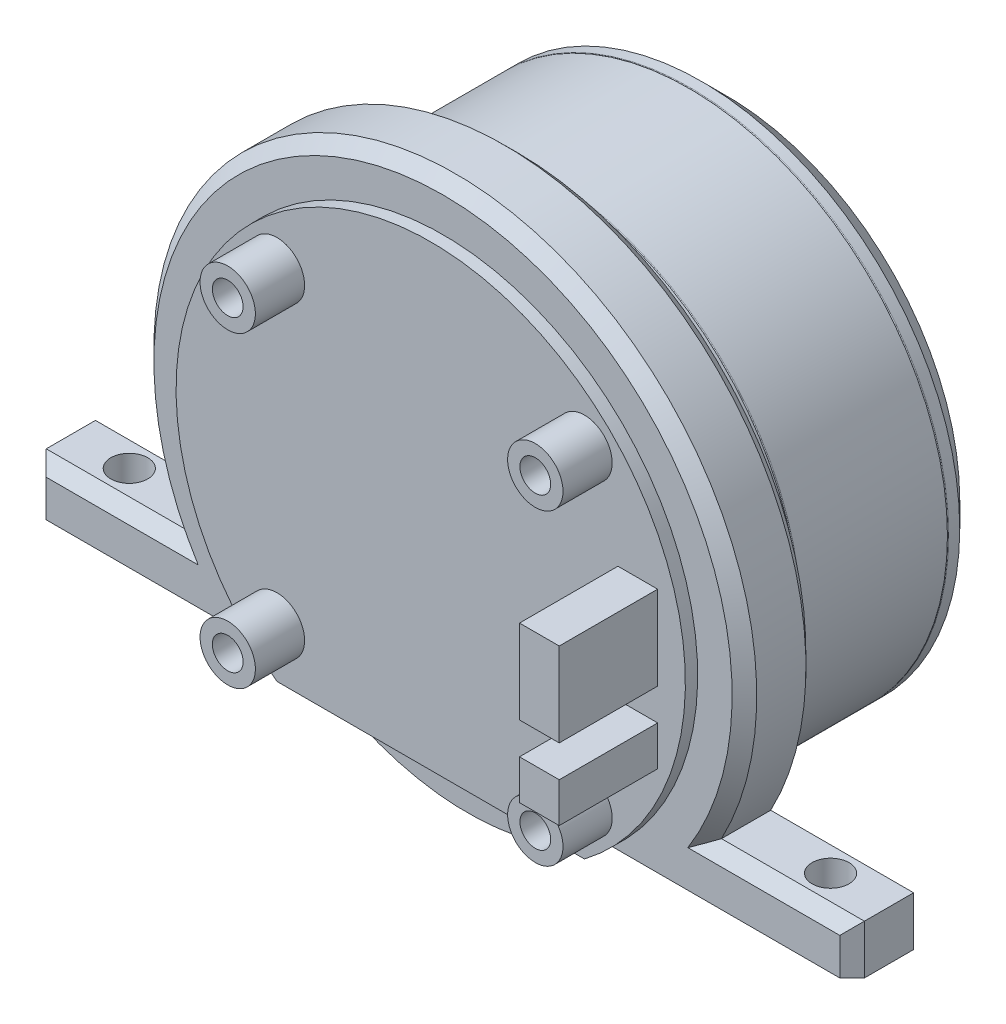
ISO-10303-21;
HEADER;
FILE_DESCRIPTION(('STEP AP214'),'2;1');
FILE_NAME('part.step','',(''),(''),'','','');
FILE_SCHEMA(('AUTOMOTIVE_DESIGN { 1 0 10303 214 1 1 1 1 }'));
ENDSEC;
DATA;
#1=APPLICATION_CONTEXT('core data for automotive mechanical design processes');
#2=APPLICATION_PROTOCOL_DEFINITION('international standard','automotive_design',2000,#1);
#3=PRODUCT_CONTEXT('',#1,'mechanical');
#4=PRODUCT('Part','Part','',(#3));
#5=PRODUCT_RELATED_PRODUCT_CATEGORY('part','',(#4));
#6=PRODUCT_DEFINITION_FORMATION('','',#4);
#7=PRODUCT_DEFINITION_CONTEXT('part definition',#1,'design');
#8=PRODUCT_DEFINITION('design','',#6,#7);
#9=PRODUCT_DEFINITION_SHAPE('','',#8);
#10=(LENGTH_UNIT() NAMED_UNIT(*) SI_UNIT(.MILLI.,.METRE.));
#11=(NAMED_UNIT(*) PLANE_ANGLE_UNIT() SI_UNIT($,.RADIAN.));
#12=(NAMED_UNIT(*) SI_UNIT($,.STERADIAN.) SOLID_ANGLE_UNIT());
#13=UNCERTAINTY_MEASURE_WITH_UNIT(LENGTH_MEASURE(1.E-05),#10,'distance_accuracy_value','');
#14=(GEOMETRIC_REPRESENTATION_CONTEXT(3) GLOBAL_UNCERTAINTY_ASSIGNED_CONTEXT((#13)) GLOBAL_UNIT_ASSIGNED_CONTEXT((#10,
#11,#12)) REPRESENTATION_CONTEXT('',''));
#15=CARTESIAN_POINT('',(0.,0.,0.));
#16=DIRECTION('',(0.,0.,1.));
#17=DIRECTION('',(1.,0.,0.));
#18=AXIS2_PLACEMENT_3D('',#15,#16,#17);
#19=CARTESIAN_POINT('',(0.,0.,24.));
#20=DIRECTION('',(0.,0.,1.));
#21=DIRECTION('',(1.,0.,0.));
#22=AXIS2_PLACEMENT_3D('',#19,#20,#21);
#23=PLANE('',#22);
#24=CARTESIAN_POINT('',(-12.5,-12.5,24.));
#25=DIRECTION('',(0.,0.,1.));
#26=DIRECTION('',(1.,0.,0.));
#27=AXIS2_PLACEMENT_3D('',#24,#25,#26);
#28=CIRCLE('',#27,2.25);
#29=CARTESIAN_POINT('',(-10.25,-12.5,24.));
#30=VERTEX_POINT('',#29);
#31=EDGE_CURVE('E295',#30,#30,#28,.T.);
#32=ORIENTED_EDGE('',*,*,#31,.F.);
#33=EDGE_LOOP('',(#32));
#34=FACE_BOUND('',#33,.T.);
#35=CARTESIAN_POINT('',(12.5,-12.5,24.));
#36=DIRECTION('',(0.,0.,1.));
#37=DIRECTION('',(1.,0.,0.));
#38=AXIS2_PLACEMENT_3D('',#35,#36,#37);
#39=CIRCLE('',#38,2.25);
#40=CARTESIAN_POINT('',(14.75,-12.5,24.));
#41=VERTEX_POINT('',#40);
#42=EDGE_CURVE('E301',#41,#41,#39,.T.);
#43=ORIENTED_EDGE('',*,*,#42,.F.);
#44=EDGE_LOOP('',(#43));
#45=FACE_BOUND('',#44,.T.);
#46=CARTESIAN_POINT('',(12.5,12.5,24.));
#47=DIRECTION('',(0.,0.,1.));
#48=DIRECTION('',(1.,0.,0.));
#49=AXIS2_PLACEMENT_3D('',#46,#47,#48);
#50=CIRCLE('',#49,2.25);
#51=CARTESIAN_POINT('',(14.75,12.5,24.));
#52=VERTEX_POINT('',#51);
#53=EDGE_CURVE('E307',#52,#52,#50,.T.);
#54=ORIENTED_EDGE('',*,*,#53,.F.);
#55=EDGE_LOOP('',(#54));
#56=FACE_BOUND('',#55,.T.);
#57=CARTESIAN_POINT('',(-12.5,12.5,24.));
#58=DIRECTION('',(0.,0.,1.));
#59=DIRECTION('',(1.,0.,0.));
#60=AXIS2_PLACEMENT_3D('',#57,#58,#59);
#61=CIRCLE('',#60,2.25);
#62=CARTESIAN_POINT('',(-10.25,12.5,24.));
#63=VERTEX_POINT('',#62);
#64=EDGE_CURVE('E310',#63,#63,#61,.T.);
#65=ORIENTED_EDGE('',*,*,#64,.F.);
#66=EDGE_LOOP('',(#65));
#67=FACE_BOUND('',#66,.T.);
#68=CARTESIAN_POINT('',(0.,0.,24.));
#69=DIRECTION('',(0.,0.,1.));
#70=DIRECTION('',(1.,0.,0.));
#71=AXIS2_PLACEMENT_3D('',#68,#69,#70);
#72=CIRCLE('',#71,20.7);
#73=CARTESIAN_POINT('',(12.4995999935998,-16.5,24.));
#74=VERTEX_POINT('',#73);
#75=CARTESIAN_POINT('',(-12.4995999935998,-16.5,24.));
#76=VERTEX_POINT('',#75);
#77=EDGE_CURVE('E318',#74,#76,#72,.T.);
#78=ORIENTED_EDGE('',*,*,#77,.T.);
#79=DIRECTION('',(1.,0.,0.));
#80=VECTOR('',#79,1.);
#81=CARTESIAN_POINT('',(12.4995999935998,-16.5,24.));
#82=LINE('',#81,#80);
#83=EDGE_CURVE('E321',#76,#74,#82,.T.);
#84=ORIENTED_EDGE('',*,*,#83,.T.);
#85=EDGE_LOOP('',(#78,#84));
#86=FACE_BOUND('',#85,.T.);
#87=DIRECTION('',(1.,0.,0.));
#88=VECTOR('',#87,1.);
#89=CARTESIAN_POINT('',(15.2166667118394,-1.35499525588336,24.));
#90=LINE('',#89,#88);
#91=CARTESIAN_POINT('',(15.2166667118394,-1.35499525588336,24.));
#92=VERTEX_POINT('',#91);
#93=CARTESIAN_POINT('',(18.4459107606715,-1.35499525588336,24.));
#94=VERTEX_POINT('',#93);
#95=EDGE_CURVE('E236',#92,#94,#90,.T.);
#96=ORIENTED_EDGE('',*,*,#95,.F.);
#97=DIRECTION('',(0.,-1.,0.));
#98=VECTOR('',#97,1.);
#99=CARTESIAN_POINT('',(15.2166667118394,5.46778546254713,24.));
#100=LINE('',#99,#98);
#101=CARTESIAN_POINT('',(15.2166667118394,5.46778546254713,24.));
#102=VERTEX_POINT('',#101);
#103=EDGE_CURVE('E233',#102,#92,#100,.T.);
#104=ORIENTED_EDGE('',*,*,#103,.F.);
#105=DIRECTION('',(-1.,0.,0.));
#106=VECTOR('',#105,1.);
#107=CARTESIAN_POINT('',(15.2166667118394,5.46778546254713,24.));
#108=LINE('',#107,#106);
#109=CARTESIAN_POINT('',(18.4459107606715,5.46778546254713,24.));
#110=VERTEX_POINT('',#109);
#111=EDGE_CURVE('E251',#110,#102,#108,.T.);
#112=ORIENTED_EDGE('',*,*,#111,.F.);
#113=DIRECTION('',(0.,1.,0.));
#114=VECTOR('',#113,1.);
#115=CARTESIAN_POINT('',(18.4459107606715,5.46778546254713,24.));
#116=LINE('',#115,#114);
#117=EDGE_CURVE('E259',#94,#110,#116,.T.);
#118=ORIENTED_EDGE('',*,*,#117,.F.);
#119=EDGE_LOOP('',(#96,#104,#112,#118));
#120=FACE_BOUND('',#119,.T.);
#121=DIRECTION('',(1.,0.,0.));
#122=VECTOR('',#121,1.);
#123=CARTESIAN_POINT('',(15.2166667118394,-7.17583818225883,24.));
#124=LINE('',#123,#122);
#125=CARTESIAN_POINT('',(15.2166667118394,-7.17583818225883,24.));
#126=VERTEX_POINT('',#125);
#127=CARTESIAN_POINT('',(18.4459107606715,-7.17583818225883,24.));
#128=VERTEX_POINT('',#127);
#129=EDGE_CURVE('E232',#126,#128,#124,.T.);
#130=ORIENTED_EDGE('',*,*,#129,.F.);
#131=DIRECTION('',(0.,-1.,0.));
#132=VECTOR('',#131,1.);
#133=CARTESIAN_POINT('',(15.2166667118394,-3.94659413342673,24.));
#134=LINE('',#133,#132);
#135=CARTESIAN_POINT('',(15.2166667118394,-3.94659413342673,24.));
#136=VERTEX_POINT('',#135);
#137=EDGE_CURVE('E227',#136,#126,#134,.T.);
#138=ORIENTED_EDGE('',*,*,#137,.F.);
#139=DIRECTION('',(-1.,0.,0.));
#140=VECTOR('',#139,1.);
#141=CARTESIAN_POINT('',(15.2166667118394,-3.94659413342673,24.));
#142=LINE('',#141,#140);
#143=CARTESIAN_POINT('',(18.4459107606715,-3.94659413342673,24.));
#144=VERTEX_POINT('',#143);
#145=EDGE_CURVE('E212',#144,#136,#142,.T.);
#146=ORIENTED_EDGE('',*,*,#145,.F.);
#147=DIRECTION('',(0.,1.,0.));
#148=VECTOR('',#147,1.);
#149=CARTESIAN_POINT('',(18.4459107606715,-3.94659413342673,24.));
#150=LINE('',#149,#148);
#151=EDGE_CURVE('E220',#128,#144,#150,.T.);
#152=ORIENTED_EDGE('',*,*,#151,.F.);
#153=EDGE_LOOP('',(#130,#138,#146,#152));
#154=FACE_BOUND('',#153,.T.);
#155=ADVANCED_FACE('F39',(#34,#45,#56,#67,#86,#120,#154),#23,.T.);
#156=CARTESIAN_POINT('',(0.,0.,21.));
#157=DIRECTION('',(0.,0.,-1.));
#158=DIRECTION('',(-1.,0.,0.));
#159=AXIS2_PLACEMENT_3D('',#156,#157,#158);
#160=CYLINDRICAL_SURFACE('',#159,21.);
#161=CARTESIAN_POINT('',(0.,0.,15.));
#162=DIRECTION('',(0.,0.,1.));
#163=DIRECTION('',(1.,0.,0.));
#164=AXIS2_PLACEMENT_3D('',#161,#162,#163);
#165=CIRCLE('',#164,21.);
#166=CARTESIAN_POINT('',(21.,0.,15.));
#167=VERTEX_POINT('',#166);
#168=EDGE_CURVE('E397',#167,#167,#165,.T.);
#169=ORIENTED_EDGE('',*,*,#168,.T.);
#170=EDGE_LOOP('',(#169));
#171=FACE_BOUND('',#170,.T.);
#172=DIRECTION('',(0.,0.,-1.));
#173=VECTOR('',#172,1.);
#174=CARTESIAN_POINT('',(14.1686273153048,-15.5,21.));
#175=LINE('',#174,#173);
#176=CARTESIAN_POINT('',(14.1686273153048,-15.5,21.));
#177=VERTEX_POINT('',#176);
#178=CARTESIAN_POINT('',(14.1686273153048,-15.5,17.));
#179=VERTEX_POINT('',#178);
#180=EDGE_CURVE('E367',#177,#179,#175,.T.);
#181=ORIENTED_EDGE('',*,*,#180,.F.);
#182=CARTESIAN_POINT('',(0.,0.,21.));
#183=DIRECTION('',(0.,0.,1.));
#184=DIRECTION('',(1.,0.,0.));
#185=AXIS2_PLACEMENT_3D('',#182,#183,#184);
#186=CIRCLE('',#185,21.);
#187=CARTESIAN_POINT('',(-14.1686273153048,-15.5,21.));
#188=VERTEX_POINT('',#187);
#189=EDGE_CURVE('E400',#188,#177,#186,.T.);
#190=ORIENTED_EDGE('',*,*,#189,.F.);
#191=DIRECTION('',(0.,0.,-1.));
#192=VECTOR('',#191,1.);
#193=CARTESIAN_POINT('',(-14.1686273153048,-15.5,21.));
#194=LINE('',#193,#192);
#195=CARTESIAN_POINT('',(-14.1686273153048,-15.5,17.));
#196=VERTEX_POINT('',#195);
#197=EDGE_CURVE('E365',#196,#188,#194,.F.);
#198=ORIENTED_EDGE('',*,*,#197,.F.);
#199=CARTESIAN_POINT('',(0.,0.,17.));
#200=DIRECTION('',(0.,0.,1.));
#201=DIRECTION('',(1.,0.,0.));
#202=AXIS2_PLACEMENT_3D('',#199,#200,#201);
#203=CIRCLE('',#202,21.);
#204=EDGE_CURVE('E429',#179,#196,#203,.T.);
#205=ORIENTED_EDGE('',*,*,#204,.F.);
#206=EDGE_LOOP('',(#181,#190,#198,#205));
#207=FACE_BOUND('',#206,.T.);
#208=ADVANCED_FACE('F582',(#171,#207),#160,.T.);
#209=CARTESIAN_POINT('',(0.,0.,21.));
#210=DIRECTION('',(0.,0.,1.));
#211=DIRECTION('',(1.,0.,0.));
#212=AXIS2_PLACEMENT_3D('',#209,#210,#211);
#213=PLANE('',#212);
#214=ORIENTED_EDGE('',*,*,#189,.T.);
#215=DIRECTION('',(-1.,0.,0.));
#216=VECTOR('',#215,1.);
#217=CARTESIAN_POINT('',(0.,-15.5,21.));
#218=LINE('',#217,#216);
#219=EDGE_CURVE('E426',#177,#188,#218,.T.);
#220=ORIENTED_EDGE('',*,*,#219,.T.);
#221=EDGE_LOOP('',(#214,#220));
#222=FACE_BOUND('',#221,.T.);
#223=ADVANCED_FACE('F590',(#222),#213,.T.);
#224=CARTESIAN_POINT('',(0.,0.,3.));
#225=DIRECTION('',(0.,0.,-1.));
#226=DIRECTION('',(-1.,0.,0.));
#227=AXIS2_PLACEMENT_3D('',#224,#225,#226);
#228=CYLINDRICAL_SURFACE('',#227,21.);
#229=CARTESIAN_POINT('',(0.,0.,2.9));
#230=DIRECTION('',(0.,0.,1.));
#231=DIRECTION('',(1.,0.,0.));
#232=AXIS2_PLACEMENT_3D('',#229,#230,#231);
#233=CIRCLE('',#232,21.);
#234=CARTESIAN_POINT('',(21.,0.,2.9));
#235=VERTEX_POINT('',#234);
#236=EDGE_CURVE('E417',#235,#235,#233,.F.);
#237=ORIENTED_EDGE('',*,*,#236,.T.);
#238=EDGE_LOOP('',(#237));
#239=FACE_BOUND('',#238,.T.);
#240=CARTESIAN_POINT('',(0.,0.,1.99999999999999));
#241=DIRECTION('',(0.,0.,1.));
#242=DIRECTION('',(1.,0.,0.));
#243=AXIS2_PLACEMENT_3D('',#240,#241,#242);
#244=CIRCLE('',#243,21.);
#245=CARTESIAN_POINT('',(21.,0.,1.99999999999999));
#246=VERTEX_POINT('',#245);
#247=EDGE_CURVE('E408',#246,#246,#244,.T.);
#248=ORIENTED_EDGE('',*,*,#247,.T.);
#249=EDGE_LOOP('',(#248));
#250=FACE_BOUND('',#249,.T.);
#251=ADVANCED_FACE('F692',(#239,#250),#228,.T.);
#252=CARTESIAN_POINT('',(0.,0.,0.));
#253=DIRECTION('',(0.,0.,1.));
#254=DIRECTION('',(1.,0.,0.));
#255=AXIS2_PLACEMENT_3D('',#252,#253,#254);
#256=PLANE('',#255);
#257=CARTESIAN_POINT('',(10.,0.,0.));
#258=DIRECTION('',(0.,0.,-1.));
#259=DIRECTION('',(-1.,0.,0.));
#260=AXIS2_PLACEMENT_3D('',#257,#258,#259);
#261=CIRCLE('',#260,1.5);
#262=CARTESIAN_POINT('',(8.5,0.,0.));
#263=VERTEX_POINT('',#262);
#264=EDGE_CURVE('E386',#263,#263,#261,.T.);
#265=ORIENTED_EDGE('',*,*,#264,.F.);
#266=EDGE_LOOP('',(#265));
#267=FACE_BOUND('',#266,.T.);
#268=CARTESIAN_POINT('',(0.,10.,0.));
#269=DIRECTION('',(0.,0.,-1.));
#270=DIRECTION('',(-1.,0.,0.));
#271=AXIS2_PLACEMENT_3D('',#268,#269,#270);
#272=CIRCLE('',#271,1.5);
#273=CARTESIAN_POINT('',(-1.50000000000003,10.,0.));
#274=VERTEX_POINT('',#273);
#275=EDGE_CURVE('E373',#274,#274,#272,.T.);
#276=ORIENTED_EDGE('',*,*,#275,.F.);
#277=EDGE_LOOP('',(#276));
#278=FACE_BOUND('',#277,.T.);
#279=CARTESIAN_POINT('',(-10.,0.,0.));
#280=DIRECTION('',(0.,0.,-1.));
#281=DIRECTION('',(-1.,0.,0.));
#282=AXIS2_PLACEMENT_3D('',#279,#280,#281);
#283=CIRCLE('',#282,1.5);
#284=CARTESIAN_POINT('',(-11.5,0.,0.));
#285=VERTEX_POINT('',#284);
#286=EDGE_CURVE('E374',#285,#285,#283,.T.);
#287=ORIENTED_EDGE('',*,*,#286,.F.);
#288=EDGE_LOOP('',(#287));
#289=FACE_BOUND('',#288,.T.);
#290=CARTESIAN_POINT('',(1.04744440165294E-13,-10.,0.));
#291=DIRECTION('',(0.,0.,-1.));
#292=DIRECTION('',(-1.,0.,0.));
#293=AXIS2_PLACEMENT_3D('',#290,#291,#292);
#294=CIRCLE('',#293,1.5);
#295=CARTESIAN_POINT('',(-1.49999999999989,-10.,0.));
#296=VERTEX_POINT('',#295);
#297=EDGE_CURVE('E369',#296,#296,#294,.T.);
#298=ORIENTED_EDGE('',*,*,#297,.F.);
#299=EDGE_LOOP('',(#298));
#300=FACE_BOUND('',#299,.T.);
#301=CARTESIAN_POINT('',(0.,0.,0.));
#302=DIRECTION('',(0.,0.,-1.));
#303=DIRECTION('',(-1.,0.,0.));
#304=AXIS2_PLACEMENT_3D('',#301,#302,#303);
#305=CIRCLE('',#304,3.);
#306=CARTESIAN_POINT('',(-3.,0.,0.));
#307=VERTEX_POINT('',#306);
#308=EDGE_CURVE('E385',#307,#307,#305,.T.);
#309=ORIENTED_EDGE('',*,*,#308,.F.);
#310=EDGE_LOOP('',(#309));
#311=FACE_BOUND('',#310,.T.);
#312=CARTESIAN_POINT('',(0.,0.,0.));
#313=DIRECTION('',(0.,0.,1.));
#314=DIRECTION('',(1.,0.,0.));
#315=AXIS2_PLACEMENT_3D('',#312,#313,#314);
#316=CIRCLE('',#315,19.);
#317=CARTESIAN_POINT('',(19.,0.,0.));
#318=VERTEX_POINT('',#317);
#319=EDGE_CURVE('E411',#318,#318,#316,.F.);
#320=ORIENTED_EDGE('',*,*,#319,.T.);
#321=EDGE_LOOP('',(#320));
#322=FACE_BOUND('',#321,.T.);
#323=ADVANCED_FACE('F707',(#267,#278,#289,#300,#311,#322),#256,.F.);
#324=CARTESIAN_POINT('',(0.,0.,1.99999999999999));
#325=DIRECTION('',(0.,0.,1.));
#326=DIRECTION('',(1.,0.,0.));
#327=AXIS2_PLACEMENT_3D('',#324,#325,#326);
#328=CONICAL_SURFACE('',#327,21.,0.78539816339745);
#329=ORIENTED_EDGE('',*,*,#319,.F.);
#330=EDGE_LOOP('',(#329));
#331=FACE_BOUND('',#330,.T.);
#332=ORIENTED_EDGE('',*,*,#247,.F.);
#333=EDGE_LOOP('',(#332));
#334=FACE_BOUND('',#333,.T.);
#335=ADVANCED_FACE('F710',(#331,#334),#328,.T.);
#336=CARTESIAN_POINT('',(0.,0.,2.9));
#337=DIRECTION('',(0.,0.,1.));
#338=DIRECTION('',(1.,0.,0.));
#339=AXIS2_PLACEMENT_3D('',#336,#337,#338);
#340=TOROIDAL_SURFACE('',#339,20.9,0.1);
#341=ORIENTED_EDGE('',*,*,#236,.F.);
#342=EDGE_LOOP('',(#341));
#343=FACE_BOUND('',#342,.T.);
#344=CARTESIAN_POINT('',(0.,0.,3.));
#345=DIRECTION('',(0.,0.,1.));
#346=DIRECTION('',(1.,0.,0.));
#347=AXIS2_PLACEMENT_3D('',#344,#345,#346);
#348=CIRCLE('',#347,20.9);
#349=CARTESIAN_POINT('',(20.9,0.,3.));
#350=VERTEX_POINT('',#349);
#351=EDGE_CURVE('E414',#350,#350,#348,.T.);
#352=ORIENTED_EDGE('',*,*,#351,.F.);
#353=EDGE_LOOP('',(#352));
#354=FACE_BOUND('',#353,.T.);
#355=ADVANCED_FACE('F705',(#343,#354),#340,.T.);
#356=CARTESIAN_POINT('',(0.,0.,15.));
#357=DIRECTION('',(0.,0.,-1.));
#358=DIRECTION('',(-1.,0.,0.));
#359=AXIS2_PLACEMENT_3D('',#356,#357,#358);
#360=CYLINDRICAL_SURFACE('',#359,21.);
#361=CARTESIAN_POINT('',(0.,0.,14.9));
#362=DIRECTION('',(0.,0.,1.));
#363=DIRECTION('',(1.,0.,0.));
#364=AXIS2_PLACEMENT_3D('',#361,#362,#363);
#365=CIRCLE('',#364,21.);
#366=CARTESIAN_POINT('',(21.,0.,14.9));
#367=VERTEX_POINT('',#366);
#368=EDGE_CURVE('E423',#367,#367,#365,.F.);
#369=ORIENTED_EDGE('',*,*,#368,.T.);
#370=EDGE_LOOP('',(#369));
#371=FACE_BOUND('',#370,.T.);
#372=CARTESIAN_POINT('',(0.,0.,3.));
#373=DIRECTION('',(0.,0.,1.));
#374=DIRECTION('',(1.,0.,0.));
#375=AXIS2_PLACEMENT_3D('',#372,#373,#374);
#376=CIRCLE('',#375,21.);
#377=CARTESIAN_POINT('',(21.,0.,3.));
#378=VERTEX_POINT('',#377);
#379=EDGE_CURVE('E403',#378,#378,#376,.T.);
#380=ORIENTED_EDGE('',*,*,#379,.T.);
#381=EDGE_LOOP('',(#380));
#382=FACE_BOUND('',#381,.T.);
#383=ADVANCED_FACE('F701',(#371,#382),#360,.T.);
#384=CARTESIAN_POINT('',(0.,0.,3.));
#385=DIRECTION('',(0.,0.,1.));
#386=DIRECTION('',(1.,0.,0.));
#387=AXIS2_PLACEMENT_3D('',#384,#385,#386);
#388=PLANE('',#387);
#389=ORIENTED_EDGE('',*,*,#351,.T.);
#390=EDGE_LOOP('',(#389));
#391=FACE_BOUND('',#390,.T.);
#392=ORIENTED_EDGE('',*,*,#379,.F.);
#393=EDGE_LOOP('',(#392));
#394=FACE_BOUND('',#393,.T.);
#395=ADVANCED_FACE('F698',(#391,#394),#388,.F.);
#396=CARTESIAN_POINT('',(0.,0.,14.9));
#397=DIRECTION('',(0.,0.,1.));
#398=DIRECTION('',(1.,0.,0.));
#399=AXIS2_PLACEMENT_3D('',#396,#397,#398);
#400=TOROIDAL_SURFACE('',#399,20.9,0.1);
#401=ORIENTED_EDGE('',*,*,#368,.F.);
#402=EDGE_LOOP('',(#401));
#403=FACE_BOUND('',#402,.T.);
#404=CARTESIAN_POINT('',(0.,0.,15.));
#405=DIRECTION('',(0.,0.,1.));
#406=DIRECTION('',(1.,0.,0.));
#407=AXIS2_PLACEMENT_3D('',#404,#405,#406);
#408=CIRCLE('',#407,20.9);
#409=CARTESIAN_POINT('',(20.9,0.,15.));
#410=VERTEX_POINT('',#409);
#411=EDGE_CURVE('E420',#410,#410,#408,.T.);
#412=ORIENTED_EDGE('',*,*,#411,.F.);
#413=EDGE_LOOP('',(#412));
#414=FACE_BOUND('',#413,.T.);
#415=ADVANCED_FACE('F695',(#403,#414),#400,.T.);
#416=CARTESIAN_POINT('',(0.,0.,15.));
#417=DIRECTION('',(0.,0.,1.));
#418=DIRECTION('',(1.,0.,0.));
#419=AXIS2_PLACEMENT_3D('',#416,#417,#418);
#420=PLANE('',#419);
#421=ORIENTED_EDGE('',*,*,#411,.T.);
#422=EDGE_LOOP('',(#421));
#423=FACE_BOUND('',#422,.T.);
#424=ORIENTED_EDGE('',*,*,#168,.F.);
#425=EDGE_LOOP('',(#424));
#426=FACE_BOUND('',#425,.T.);
#427=ADVANCED_FACE('F688',(#423,#426),#420,.F.);
#428=CARTESIAN_POINT('',(0.,0.,6.));
#429=DIRECTION('',(0.,0.,-1.));
#430=DIRECTION('',(-1.,0.,0.));
#431=AXIS2_PLACEMENT_3D('',#428,#429,#430);
#432=CYLINDRICAL_SURFACE('',#431,3.);
#433=CARTESIAN_POINT('',(0.,0.,6.));
#434=DIRECTION('',(0.,0.,-1.));
#435=DIRECTION('',(-1.,0.,0.));
#436=AXIS2_PLACEMENT_3D('',#433,#434,#435);
#437=CIRCLE('',#436,3.);
#438=CARTESIAN_POINT('',(-3.,0.,6.));
#439=VERTEX_POINT('',#438);
#440=EDGE_CURVE('E394',#439,#439,#437,.T.);
#441=ORIENTED_EDGE('',*,*,#440,.F.);
#442=EDGE_LOOP('',(#441));
#443=FACE_BOUND('',#442,.T.);
#444=ORIENTED_EDGE('',*,*,#308,.T.);
#445=EDGE_LOOP('',(#444));
#446=FACE_BOUND('',#445,.T.);
#447=ADVANCED_FACE('F684',(#443,#446),#432,.F.);
#448=CARTESIAN_POINT('',(0.,0.,6.));
#449=DIRECTION('',(0.,0.,-1.));
#450=DIRECTION('',(-1.,0.,0.));
#451=AXIS2_PLACEMENT_3D('',#448,#449,#450);
#452=PLANE('',#451);
#453=ORIENTED_EDGE('',*,*,#440,.T.);
#454=EDGE_LOOP('',(#453));
#455=FACE_BOUND('',#454,.T.);
#456=ADVANCED_FACE('F666',(#455),#452,.T.);
#457=CARTESIAN_POINT('',(1.04744440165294E-13,-10.,6.));
#458=DIRECTION('',(0.,0.,-1.));
#459=DIRECTION('',(-1.,0.,0.));
#460=AXIS2_PLACEMENT_3D('',#457,#458,#459);
#461=CYLINDRICAL_SURFACE('',#460,1.5);
#462=CARTESIAN_POINT('',(1.04744440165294E-13,-10.,6.));
#463=DIRECTION('',(0.,0.,-1.));
#464=DIRECTION('',(-1.,0.,0.));
#465=AXIS2_PLACEMENT_3D('',#462,#463,#464);
#466=CIRCLE('',#465,1.5);
#467=CARTESIAN_POINT('',(-1.49999999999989,-10.,6.));
#468=VERTEX_POINT('',#467);
#469=EDGE_CURVE('E377',#468,#468,#466,.T.);
#470=ORIENTED_EDGE('',*,*,#469,.F.);
#471=EDGE_LOOP('',(#470));
#472=FACE_BOUND('',#471,.T.);
#473=ORIENTED_EDGE('',*,*,#297,.T.);
#474=EDGE_LOOP('',(#473));
#475=FACE_BOUND('',#474,.T.);
#476=ADVANCED_FACE('F662',(#472,#475),#461,.F.);
#477=CARTESIAN_POINT('',(0.,0.,6.));
#478=DIRECTION('',(0.,0.,-1.));
#479=DIRECTION('',(-1.,0.,0.));
#480=AXIS2_PLACEMENT_3D('',#477,#478,#479);
#481=PLANE('',#480);
#482=ORIENTED_EDGE('',*,*,#469,.T.);
#483=EDGE_LOOP('',(#482));
#484=FACE_BOUND('',#483,.T.);
#485=ADVANCED_FACE('F658',(#484),#481,.T.);
#486=CARTESIAN_POINT('',(-10.,0.,6.));
#487=DIRECTION('',(0.,0.,-1.));
#488=DIRECTION('',(-1.,0.,0.));
#489=AXIS2_PLACEMENT_3D('',#486,#487,#488);
#490=CYLINDRICAL_SURFACE('',#489,1.5);
#491=CARTESIAN_POINT('',(-10.,0.,6.));
#492=DIRECTION('',(0.,0.,-1.));
#493=DIRECTION('',(-1.,0.,0.));
#494=AXIS2_PLACEMENT_3D('',#491,#492,#493);
#495=CIRCLE('',#494,1.5);
#496=CARTESIAN_POINT('',(-11.5,0.,6.));
#497=VERTEX_POINT('',#496);
#498=EDGE_CURVE('E370',#497,#497,#495,.T.);
#499=ORIENTED_EDGE('',*,*,#498,.F.);
#500=EDGE_LOOP('',(#499));
#501=FACE_BOUND('',#500,.T.);
#502=ORIENTED_EDGE('',*,*,#286,.T.);
#503=EDGE_LOOP('',(#502));
#504=FACE_BOUND('',#503,.T.);
#505=ADVANCED_FACE('F654',(#501,#504),#490,.F.);
#506=CARTESIAN_POINT('',(0.,0.,6.));
#507=DIRECTION('',(0.,0.,-1.));
#508=DIRECTION('',(-1.,0.,0.));
#509=AXIS2_PLACEMENT_3D('',#506,#507,#508);
#510=PLANE('',#509);
#511=ORIENTED_EDGE('',*,*,#498,.T.);
#512=EDGE_LOOP('',(#511));
#513=FACE_BOUND('',#512,.T.);
#514=ADVANCED_FACE('F650',(#513),#510,.T.);
#515=CARTESIAN_POINT('',(0.,10.,6.));
#516=DIRECTION('',(0.,0.,-1.));
#517=DIRECTION('',(-1.,0.,0.));
#518=AXIS2_PLACEMENT_3D('',#515,#516,#517);
#519=CYLINDRICAL_SURFACE('',#518,1.5);
#520=CARTESIAN_POINT('',(0.,10.,6.));
#521=DIRECTION('',(0.,0.,-1.));
#522=DIRECTION('',(-1.,0.,0.));
#523=AXIS2_PLACEMENT_3D('',#520,#521,#522);
#524=CIRCLE('',#523,1.5);
#525=CARTESIAN_POINT('',(-1.50000000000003,10.,6.));
#526=VERTEX_POINT('',#525);
#527=EDGE_CURVE('E389',#526,#526,#524,.T.);
#528=ORIENTED_EDGE('',*,*,#527,.F.);
#529=EDGE_LOOP('',(#528));
#530=FACE_BOUND('',#529,.T.);
#531=ORIENTED_EDGE('',*,*,#275,.T.);
#532=EDGE_LOOP('',(#531));
#533=FACE_BOUND('',#532,.T.);
#534=ADVANCED_FACE('F653',(#530,#533),#519,.F.);
#535=CARTESIAN_POINT('',(0.,0.,6.));
#536=DIRECTION('',(0.,0.,-1.));
#537=DIRECTION('',(-1.,0.,0.));
#538=AXIS2_PLACEMENT_3D('',#535,#536,#537);
#539=PLANE('',#538);
#540=ORIENTED_EDGE('',*,*,#527,.T.);
#541=EDGE_LOOP('',(#540));
#542=FACE_BOUND('',#541,.T.);
#543=ADVANCED_FACE('F674',(#542),#539,.T.);
#544=CARTESIAN_POINT('',(10.,0.,6.));
#545=DIRECTION('',(0.,0.,-1.));
#546=DIRECTION('',(-1.,0.,0.));
#547=AXIS2_PLACEMENT_3D('',#544,#545,#546);
#548=CYLINDRICAL_SURFACE('',#547,1.5);
#549=CARTESIAN_POINT('',(10.,0.,6.));
#550=DIRECTION('',(0.,0.,-1.));
#551=DIRECTION('',(-1.,0.,0.));
#552=AXIS2_PLACEMENT_3D('',#549,#550,#551);
#553=CIRCLE('',#552,1.5);
#554=CARTESIAN_POINT('',(8.5,0.,6.));
#555=VERTEX_POINT('',#554);
#556=EDGE_CURVE('E382',#555,#555,#553,.T.);
#557=ORIENTED_EDGE('',*,*,#556,.F.);
#558=EDGE_LOOP('',(#557));
#559=FACE_BOUND('',#558,.T.);
#560=ORIENTED_EDGE('',*,*,#264,.T.);
#561=EDGE_LOOP('',(#560));
#562=FACE_BOUND('',#561,.T.);
#563=ADVANCED_FACE('F670',(#559,#562),#548,.F.);
#564=CARTESIAN_POINT('',(0.,0.,6.));
#565=DIRECTION('',(0.,0.,-1.));
#566=DIRECTION('',(-1.,0.,0.));
#567=AXIS2_PLACEMENT_3D('',#564,#565,#566);
#568=PLANE('',#567);
#569=ORIENTED_EDGE('',*,*,#556,.T.);
#570=EDGE_LOOP('',(#569));
#571=FACE_BOUND('',#570,.T.);
#572=ADVANCED_FACE('F638',(#571),#568,.T.);
#573=CARTESIAN_POINT('',(-33.25,-15.5,23.));
#574=DIRECTION('',(0.,1.,0.));
#575=DIRECTION('',(-1.,0.,0.));
#576=AXIS2_PLACEMENT_3D('',#573,#574,#575);
#577=PLANE('',#576);
#578=CARTESIAN_POINT('',(28.5,-15.5,20.));
#579=DIRECTION('',(0.,1.,0.));
#580=DIRECTION('',(-1.,0.,0.));
#581=AXIS2_PLACEMENT_3D('',#578,#579,#580);
#582=CIRCLE('',#581,1.5);
#583=CARTESIAN_POINT('',(27.,-15.5,20.));
#584=VERTEX_POINT('',#583);
#585=EDGE_CURVE('E333',#584,#584,#582,.T.);
#586=ORIENTED_EDGE('',*,*,#585,.T.);
#587=EDGE_LOOP('',(#586));
#588=FACE_BOUND('',#587,.T.);
#589=CARTESIAN_POINT('',(-28.5,-15.5,20.));
#590=DIRECTION('',(0.,1.,0.));
#591=DIRECTION('',(-1.,0.,0.));
#592=AXIS2_PLACEMENT_3D('',#589,#590,#591);
#593=CIRCLE('',#592,1.5);
#594=CARTESIAN_POINT('',(-30.,-15.5,20.));
#595=VERTEX_POINT('',#594);
#596=EDGE_CURVE('E336',#595,#595,#593,.T.);
#597=ORIENTED_EDGE('',*,*,#596,.T.);
#598=EDGE_LOOP('',(#597));
#599=FACE_BOUND('',#598,.T.);
#600=DIRECTION('',(0.,0.,-1.));
#601=VECTOR('',#600,1.);
#602=CARTESIAN_POINT('',(-33.25,-15.5,23.));
#603=LINE('',#602,#601);
#604=CARTESIAN_POINT('',(-33.25,-15.5,22.));
#605=VERTEX_POINT('',#604);
#606=CARTESIAN_POINT('',(-33.25,-15.5,18.));
#607=VERTEX_POINT('',#606);
#608=EDGE_CURVE('E356',#605,#607,#603,.T.);
#609=ORIENTED_EDGE('',*,*,#608,.T.);
#610=DIRECTION('',(-0.70710678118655,0.,0.707106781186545));
#611=VECTOR('',#610,1.);
#612=CARTESIAN_POINT('',(-33.25,-15.5,18.));
#613=LINE('',#612,#611);
#614=CARTESIAN_POINT('',(-32.25,-15.5,17.));
#615=VERTEX_POINT('',#614);
#616=EDGE_CURVE('E444',#607,#615,#613,.F.);
#617=ORIENTED_EDGE('',*,*,#616,.T.);
#618=DIRECTION('',(1.,0.,0.));
#619=VECTOR('',#618,1.);
#620=CARTESIAN_POINT('',(-33.25,-15.5,17.));
#621=LINE('',#620,#619);
#622=EDGE_CURVE('E345',#615,#196,#621,.T.);
#623=ORIENTED_EDGE('',*,*,#622,.T.);
#624=ORIENTED_EDGE('',*,*,#197,.T.);
#625=ORIENTED_EDGE('',*,*,#219,.F.);
#626=ORIENTED_EDGE('',*,*,#180,.T.);
#627=CARTESIAN_POINT('',(32.25,-15.5,17.));
#628=VERTEX_POINT('',#627);
#629=EDGE_CURVE('E347',#179,#628,#621,.T.);
#630=ORIENTED_EDGE('',*,*,#629,.T.);
#631=DIRECTION('',(-0.70710678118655,0.,-0.707106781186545));
#632=VECTOR('',#631,1.);
#633=CARTESIAN_POINT('',(33.25,-15.5,18.));
#634=LINE('',#633,#632);
#635=CARTESIAN_POINT('',(33.25,-15.5,18.));
#636=VERTEX_POINT('',#635);
#637=EDGE_CURVE('E442',#628,#636,#634,.F.);
#638=ORIENTED_EDGE('',*,*,#637,.T.);
#639=DIRECTION('',(0.,0.,-1.));
#640=VECTOR('',#639,1.);
#641=CARTESIAN_POINT('',(33.25,-15.5,23.));
#642=LINE('',#641,#640);
#643=CARTESIAN_POINT('',(33.25,-15.5,22.));
#644=VERTEX_POINT('',#643);
#645=EDGE_CURVE('E353',#644,#636,#642,.T.);
#646=ORIENTED_EDGE('',*,*,#645,.F.);
#647=DIRECTION('',(-0.707106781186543,0.,0.707106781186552));
#648=VECTOR('',#647,1.);
#649=CARTESIAN_POINT('',(32.25,-15.5,23.));
#650=LINE('',#649,#648);
#651=CARTESIAN_POINT('',(32.25,-15.5,23.));
#652=VERTEX_POINT('',#651);
#653=EDGE_CURVE('E437',#644,#652,#650,.T.);
#654=ORIENTED_EDGE('',*,*,#653,.T.);
#655=DIRECTION('',(1.,0.,0.));
#656=VECTOR('',#655,1.);
#657=CARTESIAN_POINT('',(-33.25,-15.5,23.));
#658=LINE('',#657,#656);
#659=CARTESIAN_POINT('',(13.720058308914,-15.5,23.));
#660=VERTEX_POINT('',#659);
#661=EDGE_CURVE('E344',#660,#652,#658,.T.);
#662=ORIENTED_EDGE('',*,*,#661,.F.);
#663=CARTESIAN_POINT('',(-13.720058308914,-15.5,23.));
#664=VERTEX_POINT('',#663);
#665=EDGE_CURVE('E343',#664,#660,#658,.T.);
#666=ORIENTED_EDGE('',*,*,#665,.F.);
#667=CARTESIAN_POINT('',(-32.25,-15.5,23.));
#668=VERTEX_POINT('',#667);
#669=EDGE_CURVE('E340',#668,#664,#658,.T.);
#670=ORIENTED_EDGE('',*,*,#669,.F.);
#671=DIRECTION('',(-0.707106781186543,0.,-0.707106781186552));
#672=VECTOR('',#671,1.);
#673=CARTESIAN_POINT('',(-32.25,-15.5,23.));
#674=LINE('',#673,#672);
#675=EDGE_CURVE('E440',#668,#605,#674,.T.);
#676=ORIENTED_EDGE('',*,*,#675,.T.);
#677=EDGE_LOOP('',(#609,#617,#623,#624,#625,#626,#630,#638,#646,#654,#662,#666,#670,#676));
#678=FACE_BOUND('',#677,.T.);
#679=ADVANCED_FACE('F634',(#588,#599,#678),#577,.F.);
#680=CARTESIAN_POINT('',(0.,0.,23.));
#681=DIRECTION('',(0.,0.,-1.));
#682=DIRECTION('',(-1.,0.,0.));
#683=AXIS2_PLACEMENT_3D('',#680,#681,#682);
#684=CYLINDRICAL_SURFACE('',#683,24.5);
#685=DIRECTION('',(0.,0.,-1.));
#686=VECTOR('',#685,1.);
#687=CARTESIAN_POINT('',(21.6333076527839,-11.5,23.));
#688=LINE('',#687,#686);
#689=CARTESIAN_POINT('',(21.6333076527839,-11.5,22.));
#690=VERTEX_POINT('',#689);
#691=CARTESIAN_POINT('',(21.6333076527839,-11.5,18.));
#692=VERTEX_POINT('',#691);
#693=EDGE_CURVE('E342',#690,#692,#688,.T.);
#694=ORIENTED_EDGE('',*,*,#693,.T.);
#695=CARTESIAN_POINT('',(0.,0.,18.));
#696=DIRECTION('',(0.,0.,1.));
#697=DIRECTION('',(1.,0.,0.));
#698=AXIS2_PLACEMENT_3D('',#695,#696,#697);
#699=CIRCLE('',#698,24.5);
#700=CARTESIAN_POINT('',(-21.6333076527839,-11.5,18.));
#701=VERTEX_POINT('',#700);
#702=EDGE_CURVE('E470',#692,#701,#699,.T.);
#703=ORIENTED_EDGE('',*,*,#702,.T.);
#704=DIRECTION('',(0.,0.,-1.));
#705=VECTOR('',#704,1.);
#706=CARTESIAN_POINT('',(-21.6333076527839,-11.5,23.));
#707=LINE('',#706,#705);
#708=CARTESIAN_POINT('',(-21.6333076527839,-11.5,22.));
#709=VERTEX_POINT('',#708);
#710=EDGE_CURVE('E362',#709,#701,#707,.T.);
#711=ORIENTED_EDGE('',*,*,#710,.F.);
#712=CARTESIAN_POINT('',(0.,0.,22.));
#713=DIRECTION('',(0.,0.,1.));
#714=DIRECTION('',(1.,0.,0.));
#715=AXIS2_PLACEMENT_3D('',#712,#713,#714);
#716=CIRCLE('',#715,24.5);
#717=EDGE_CURVE('E468',#709,#690,#716,.F.);
#718=ORIENTED_EDGE('',*,*,#717,.T.);
#719=EDGE_LOOP('',(#694,#703,#711,#718));
#720=FACE_BOUND('',#719,.T.);
#721=ADVANCED_FACE('F637',(#720),#684,.T.);
#722=CARTESIAN_POINT('',(-33.25,-11.5,23.));
#723=DIRECTION('',(0.,-1.,0.));
#724=DIRECTION('',(1.,0.,0.));
#725=AXIS2_PLACEMENT_3D('',#722,#723,#724);
#726=PLANE('',#725);
#727=CARTESIAN_POINT('',(-28.5,-11.5,20.));
#728=DIRECTION('',(0.,-1.,0.));
#729=DIRECTION('',(1.,0.,0.));
#730=AXIS2_PLACEMENT_3D('',#727,#728,#729);
#731=CIRCLE('',#730,1.5);
#732=CARTESIAN_POINT('',(-30.,-11.5,20.));
#733=VERTEX_POINT('',#732);
#734=EDGE_CURVE('E44',#733,#733,#731,.T.);
#735=ORIENTED_EDGE('',*,*,#734,.T.);
#736=EDGE_LOOP('',(#735));
#737=FACE_BOUND('',#736,.T.);
#738=ORIENTED_EDGE('',*,*,#710,.T.);
#739=DIRECTION('',(-1.,0.,0.));
#740=VECTOR('',#739,1.);
#741=CARTESIAN_POINT('',(-33.25,-11.5,18.));
#742=LINE('',#741,#740);
#743=CARTESIAN_POINT('',(-33.25,-11.5,18.));
#744=VERTEX_POINT('',#743);
#745=EDGE_CURVE('E458',#701,#744,#742,.T.);
#746=ORIENTED_EDGE('',*,*,#745,.T.);
#747=DIRECTION('',(0.,0.,-1.));
#748=VECTOR('',#747,1.);
#749=CARTESIAN_POINT('',(-33.25,-11.5,23.));
#750=LINE('',#749,#748);
#751=CARTESIAN_POINT('',(-33.25,-11.5,22.));
#752=VERTEX_POINT('',#751);
#753=EDGE_CURVE('E359',#752,#744,#750,.T.);
#754=ORIENTED_EDGE('',*,*,#753,.F.);
#755=DIRECTION('',(1.,0.,0.));
#756=VECTOR('',#755,1.);
#757=CARTESIAN_POINT('',(-21.6333076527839,-11.5,22.));
#758=LINE('',#757,#756);
#759=EDGE_CURVE('E456',#752,#709,#758,.T.);
#760=ORIENTED_EDGE('',*,*,#759,.T.);
#761=EDGE_LOOP('',(#738,#746,#754,#760));
#762=FACE_BOUND('',#761,.T.);
#763=ADVANCED_FACE('F642',(#737,#762),#726,.F.);
#764=CARTESIAN_POINT('',(-33.25,-15.5,23.));
#765=DIRECTION('',(1.,0.,0.));
#766=DIRECTION('',(0.,0.,-1.));
#767=AXIS2_PLACEMENT_3D('',#764,#765,#766);
#768=PLANE('',#767);
#769=ORIENTED_EDGE('',*,*,#753,.T.);
#770=DIRECTION('',(0.,-1.,0.));
#771=VECTOR('',#770,1.);
#772=CARTESIAN_POINT('',(-33.25,-15.5,18.));
#773=LINE('',#772,#771);
#774=EDGE_CURVE('E434',#744,#607,#773,.T.);
#775=ORIENTED_EDGE('',*,*,#774,.T.);
#776=ORIENTED_EDGE('',*,*,#608,.F.);
#777=DIRECTION('',(0.,1.,0.));
#778=VECTOR('',#777,1.);
#779=CARTESIAN_POINT('',(-33.25,-11.5,22.));
#780=LINE('',#779,#778);
#781=EDGE_CURVE('E432',#605,#752,#780,.T.);
#782=ORIENTED_EDGE('',*,*,#781,.T.);
#783=EDGE_LOOP('',(#769,#775,#776,#782));
#784=FACE_BOUND('',#783,.T.);
#785=ADVANCED_FACE('F632',(#784),#768,.F.);
#786=CARTESIAN_POINT('',(33.25,-15.5,23.));
#787=DIRECTION('',(-1.,0.,0.));
#788=DIRECTION('',(0.,0.,1.));
#789=AXIS2_PLACEMENT_3D('',#786,#787,#788);
#790=PLANE('',#789);
#791=ORIENTED_EDGE('',*,*,#645,.T.);
#792=DIRECTION('',(0.,1.,0.));
#793=VECTOR('',#792,1.);
#794=CARTESIAN_POINT('',(33.25,-15.5,18.));
#795=LINE('',#794,#793);
#796=CARTESIAN_POINT('',(33.25,-11.5,18.));
#797=VERTEX_POINT('',#796);
#798=EDGE_CURVE('E462',#636,#797,#795,.T.);
#799=ORIENTED_EDGE('',*,*,#798,.T.);
#800=DIRECTION('',(0.,0.,-1.));
#801=VECTOR('',#800,1.);
#802=CARTESIAN_POINT('',(33.25,-11.5,23.));
#803=LINE('',#802,#801);
#804=CARTESIAN_POINT('',(33.25,-11.5,22.));
#805=VERTEX_POINT('',#804);
#806=EDGE_CURVE('E350',#805,#797,#803,.T.);
#807=ORIENTED_EDGE('',*,*,#806,.F.);
#808=DIRECTION('',(0.,-1.,0.));
#809=VECTOR('',#808,1.);
#810=CARTESIAN_POINT('',(33.25,-15.5,22.));
#811=LINE('',#810,#809);
#812=EDGE_CURVE('E460',#805,#644,#811,.T.);
#813=ORIENTED_EDGE('',*,*,#812,.T.);
#814=EDGE_LOOP('',(#791,#799,#807,#813));
#815=FACE_BOUND('',#814,.T.);
#816=ADVANCED_FACE('F628',(#815),#790,.F.);
#817=CARTESIAN_POINT('',(21.6333076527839,-11.5,23.));
#818=DIRECTION('',(0.,-1.,0.));
#819=DIRECTION('',(1.,0.,0.));
#820=AXIS2_PLACEMENT_3D('',#817,#818,#819);
#821=PLANE('',#820);
#822=CARTESIAN_POINT('',(28.5,-11.5,20.));
#823=DIRECTION('',(0.,-1.,0.));
#824=DIRECTION('',(1.,0.,0.));
#825=AXIS2_PLACEMENT_3D('',#822,#823,#824);
#826=CIRCLE('',#825,1.5);
#827=CARTESIAN_POINT('',(27.,-11.5,20.));
#828=VERTEX_POINT('',#827);
#829=EDGE_CURVE('E332',#828,#828,#826,.T.);
#830=ORIENTED_EDGE('',*,*,#829,.T.);
#831=EDGE_LOOP('',(#830));
#832=FACE_BOUND('',#831,.T.);
#833=ORIENTED_EDGE('',*,*,#806,.T.);
#834=DIRECTION('',(-1.,0.,0.));
#835=VECTOR('',#834,1.);
#836=CARTESIAN_POINT('',(21.6333076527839,-11.5,18.));
#837=LINE('',#836,#835);
#838=EDGE_CURVE('E466',#797,#692,#837,.T.);
#839=ORIENTED_EDGE('',*,*,#838,.T.);
#840=ORIENTED_EDGE('',*,*,#693,.F.);
#841=DIRECTION('',(1.,0.,0.));
#842=VECTOR('',#841,1.);
#843=CARTESIAN_POINT('',(33.25,-11.5,22.));
#844=LINE('',#843,#842);
#845=EDGE_CURVE('E464',#690,#805,#844,.T.);
#846=ORIENTED_EDGE('',*,*,#845,.T.);
#847=EDGE_LOOP('',(#833,#839,#840,#846));
#848=FACE_BOUND('',#847,.T.);
#849=ADVANCED_FACE('F621',(#832,#848),#821,.F.);
#850=CARTESIAN_POINT('',(0.,0.,23.));
#851=DIRECTION('',(0.,0.,1.));
#852=DIRECTION('',(1.,0.,0.));
#853=AXIS2_PLACEMENT_3D('',#850,#851,#852);
#854=PLANE('',#853);
#855=CARTESIAN_POINT('',(0.,0.,23.));
#856=DIRECTION('',(0.,0.,1.));
#857=DIRECTION('',(1.,0.,0.));
#858=AXIS2_PLACEMENT_3D('',#855,#856,#857);
#859=CIRCLE('',#858,20.7);
#860=EDGE_CURVE('E11',#660,#664,#859,.T.);
#861=ORIENTED_EDGE('',*,*,#860,.F.);
#862=ORIENTED_EDGE('',*,*,#661,.T.);
#863=DIRECTION('',(0.,1.,0.));
#864=VECTOR('',#863,1.);
#865=CARTESIAN_POINT('',(32.25,-11.5,23.));
#866=LINE('',#865,#864);
#867=CARTESIAN_POINT('',(32.25,-12.5,23.));
#868=VERTEX_POINT('',#867);
#869=EDGE_CURVE('E476',#652,#868,#866,.T.);
#870=ORIENTED_EDGE('',*,*,#869,.T.);
#871=DIRECTION('',(-1.,0.,0.));
#872=VECTOR('',#871,1.);
#873=CARTESIAN_POINT('',(21.6333076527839,-12.5,23.));
#874=LINE('',#873,#872);
#875=CARTESIAN_POINT('',(19.8997487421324,-12.5,23.));
#876=VERTEX_POINT('',#875);
#877=EDGE_CURVE('E474',#868,#876,#874,.T.);
#878=ORIENTED_EDGE('',*,*,#877,.T.);
#879=CARTESIAN_POINT('',(0.,0.,23.));
#880=DIRECTION('',(0.,0.,1.));
#881=DIRECTION('',(1.,0.,0.));
#882=AXIS2_PLACEMENT_3D('',#879,#880,#881);
#883=CIRCLE('',#882,23.5);
#884=CARTESIAN_POINT('',(-19.8997487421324,-12.5,23.));
#885=VERTEX_POINT('',#884);
#886=EDGE_CURVE('E472',#876,#885,#883,.T.);
#887=ORIENTED_EDGE('',*,*,#886,.T.);
#888=DIRECTION('',(-1.,0.,0.));
#889=VECTOR('',#888,1.);
#890=CARTESIAN_POINT('',(-33.25,-12.5,23.));
#891=LINE('',#890,#889);
#892=CARTESIAN_POINT('',(-32.25,-12.5,23.));
#893=VERTEX_POINT('',#892);
#894=EDGE_CURVE('E478',#885,#893,#891,.T.);
#895=ORIENTED_EDGE('',*,*,#894,.T.);
#896=DIRECTION('',(0.,-1.,0.));
#897=VECTOR('',#896,1.);
#898=CARTESIAN_POINT('',(-32.25,-15.5,23.));
#899=LINE('',#898,#897);
#900=EDGE_CURVE('E49',#893,#668,#899,.T.);
#901=ORIENTED_EDGE('',*,*,#900,.T.);
#902=ORIENTED_EDGE('',*,*,#669,.T.);
#903=EDGE_LOOP('',(#861,#862,#870,#878,#887,#895,#901,#902));
#904=FACE_BOUND('',#903,.T.);
#905=ADVANCED_FACE('F618',(#904),#854,.T.);
#906=CARTESIAN_POINT('',(0.,0.,17.));
#907=DIRECTION('',(0.,0.,1.));
#908=DIRECTION('',(1.,0.,0.));
#909=AXIS2_PLACEMENT_3D('',#906,#907,#908);
#910=PLANE('',#909);
#911=ORIENTED_EDGE('',*,*,#622,.F.);
#912=DIRECTION('',(0.,1.,0.));
#913=VECTOR('',#912,1.);
#914=CARTESIAN_POINT('',(-32.25,0.,17.));
#915=LINE('',#914,#913);
#916=CARTESIAN_POINT('',(-32.25,-12.5,17.));
#917=VERTEX_POINT('',#916);
#918=EDGE_CURVE('E454',#615,#917,#915,.T.);
#919=ORIENTED_EDGE('',*,*,#918,.T.);
#920=DIRECTION('',(1.,0.,0.));
#921=VECTOR('',#920,1.);
#922=CARTESIAN_POINT('',(0.,-12.5,17.));
#923=LINE('',#922,#921);
#924=CARTESIAN_POINT('',(-19.8997487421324,-12.5,17.));
#925=VERTEX_POINT('',#924);
#926=EDGE_CURVE('E452',#917,#925,#923,.T.);
#927=ORIENTED_EDGE('',*,*,#926,.T.);
#928=CARTESIAN_POINT('',(0.,0.,17.));
#929=DIRECTION('',(0.,0.,1.));
#930=DIRECTION('',(1.,0.,0.));
#931=AXIS2_PLACEMENT_3D('',#928,#929,#930);
#932=CIRCLE('',#931,23.5);
#933=CARTESIAN_POINT('',(19.8997487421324,-12.5,17.));
#934=VERTEX_POINT('',#933);
#935=EDGE_CURVE('E446',#925,#934,#932,.F.);
#936=ORIENTED_EDGE('',*,*,#935,.T.);
#937=DIRECTION('',(1.,0.,0.));
#938=VECTOR('',#937,1.);
#939=CARTESIAN_POINT('',(0.,-12.5,17.));
#940=LINE('',#939,#938);
#941=CARTESIAN_POINT('',(32.25,-12.5,17.));
#942=VERTEX_POINT('',#941);
#943=EDGE_CURVE('E448',#934,#942,#940,.T.);
#944=ORIENTED_EDGE('',*,*,#943,.T.);
#945=DIRECTION('',(0.,-1.,0.));
#946=VECTOR('',#945,1.);
#947=CARTESIAN_POINT('',(32.25,0.,17.));
#948=LINE('',#947,#946);
#949=EDGE_CURVE('E450',#942,#628,#948,.T.);
#950=ORIENTED_EDGE('',*,*,#949,.T.);
#951=ORIENTED_EDGE('',*,*,#629,.F.);
#952=ORIENTED_EDGE('',*,*,#204,.T.);
#953=EDGE_LOOP('',(#911,#919,#927,#936,#944,#950,#951,#952));
#954=FACE_BOUND('',#953,.T.);
#955=ADVANCED_FACE('F529',(#954),#910,.F.);
#956=CARTESIAN_POINT('',(33.25,-15.5,18.));
#957=DIRECTION('',(-0.707106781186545,0.,0.70710678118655));
#958=DIRECTION('',(0.,1.,0.));
#959=AXIS2_PLACEMENT_3D('',#956,#957,#958);
#960=PLANE('',#959);
#961=ORIENTED_EDGE('',*,*,#637,.F.);
#962=ORIENTED_EDGE('',*,*,#949,.F.);
#963=DIRECTION('',(-0.577350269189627,-0.577350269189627,-0.577350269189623));
#964=VECTOR('',#963,1.);
#965=CARTESIAN_POINT('',(29.3777692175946,-15.3722307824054,14.1277692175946));
#966=LINE('',#965,#964);
#967=EDGE_CURVE('E747',#797,#942,#966,.T.);
#968=ORIENTED_EDGE('',*,*,#967,.F.);
#969=ORIENTED_EDGE('',*,*,#798,.F.);
#970=EDGE_LOOP('',(#961,#962,#968,#969));
#971=FACE_BOUND('',#970,.T.);
#972=ADVANCED_FACE('F522',(#971),#960,.F.);
#973=CARTESIAN_POINT('',(21.6333076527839,-11.5,18.));
#974=DIRECTION('',(0.,-0.707106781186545,0.70710678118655));
#975=DIRECTION('',(-1.,0.,0.));
#976=AXIS2_PLACEMENT_3D('',#973,#974,#975);
#977=PLANE('',#976);
#978=ORIENTED_EDGE('',*,*,#967,.T.);
#979=ORIENTED_EDGE('',*,*,#943,.F.);
#980=CARTESIAN_POINT('',(21.6333076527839,-11.5,18.));
#981=CARTESIAN_POINT('',(21.4912261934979,-11.5853801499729,17.9146198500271));
#982=CARTESIAN_POINT('',(21.3485576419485,-11.6702723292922,17.8297276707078));
#983=CARTESIAN_POINT('',(21.0620459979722,-11.8390380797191,17.6609619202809));
#984=CARTESIAN_POINT('',(20.9182030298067,-11.9229117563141,17.5770882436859));
#985=CARTESIAN_POINT('',(20.6293116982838,-12.0896161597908,17.4103838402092));
#986=CARTESIAN_POINT('',(20.4842633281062,-12.1724468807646,17.3275531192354));
#987=CARTESIAN_POINT('',(20.1929320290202,-12.3370376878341,17.1629623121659));
#988=CARTESIAN_POINT('',(20.0466489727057,-12.4187976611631,17.0812023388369));
#989=CARTESIAN_POINT('',(19.8997487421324,-12.5,17.));
#990=B_SPLINE_CURVE_WITH_KNOTS('',3,(#980,#981,#982,#983,#984,#985,#986,#987,#988,#989),
.UNSPECIFIED.,.F.,.F.,(4,2,2,2,4),(0.,0.55937325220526,1.11868806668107,1.678006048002,
2.23738246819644),.UNSPECIFIED.);
#991=EDGE_CURVE('E495',#692,#934,#990,.T.);
#992=ORIENTED_EDGE('',*,*,#991,.F.);
#993=ORIENTED_EDGE('',*,*,#838,.F.);
#994=EDGE_LOOP('',(#978,#979,#992,#993));
#995=FACE_BOUND('',#994,.T.);
#996=ADVANCED_FACE('F513',(#995),#977,.F.);
#997=CARTESIAN_POINT('',(0.,0.,18.));
#998=DIRECTION('',(0.,0.,1.));
#999=DIRECTION('',(1.,0.,0.));
#1000=AXIS2_PLACEMENT_3D('',#997,#998,#999);
#1001=CONICAL_SURFACE('',#1000,24.5,0.785398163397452);
#1002=ORIENTED_EDGE('',*,*,#991,.T.);
#1003=ORIENTED_EDGE('',*,*,#935,.F.);
#1004=CARTESIAN_POINT('',(-19.8997487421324,-12.5,17.));
#1005=CARTESIAN_POINT('',(-20.0466489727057,-12.4187976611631,17.0812023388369));
#1006=CARTESIAN_POINT('',(-20.1929320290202,-12.3370376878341,17.1629623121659));
#1007=CARTESIAN_POINT('',(-20.4842633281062,-12.1724468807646,17.3275531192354));
#1008=CARTESIAN_POINT('',(-20.6293116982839,-12.0896161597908,17.4103838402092));
#1009=CARTESIAN_POINT('',(-20.9182030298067,-11.9229117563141,17.5770882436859));
#1010=CARTESIAN_POINT('',(-21.0620459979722,-11.8390380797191,17.6609619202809));
#1011=CARTESIAN_POINT('',(-21.3485576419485,-11.6702723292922,17.8297276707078));
#1012=CARTESIAN_POINT('',(-21.4912261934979,-11.5853801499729,17.9146198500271));
#1013=CARTESIAN_POINT('',(-21.6333076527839,-11.5,18.));
#1014=B_SPLINE_CURVE_WITH_KNOTS('',3,(#1004,#1005,#1006,#1007,#1008,#1009,#1010,#1011,#1012,
#1013),.UNSPECIFIED.,.F.,.F.,(4,2,2,2,4),(0.,0.559376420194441,1.11869440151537,
1.67800921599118,2.23738246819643),.UNSPECIFIED.);
#1015=EDGE_CURVE('E485',#701,#925,#1014,.F.);
#1016=ORIENTED_EDGE('',*,*,#1015,.F.);
#1017=ORIENTED_EDGE('',*,*,#702,.F.);
#1018=EDGE_LOOP('',(#1002,#1003,#1016,#1017));
#1019=FACE_BOUND('',#1018,.T.);
#1020=ADVANCED_FACE('F507',(#1019),#1001,.T.);
#1021=CARTESIAN_POINT('',(-33.25,-11.5,18.));
#1022=DIRECTION('',(0.,-0.707106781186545,0.70710678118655));
#1023=DIRECTION('',(-1.,0.,0.));
#1024=AXIS2_PLACEMENT_3D('',#1021,#1022,#1023);
#1025=PLANE('',#1024);
#1026=ORIENTED_EDGE('',*,*,#1015,.T.);
#1027=ORIENTED_EDGE('',*,*,#926,.F.);
#1028=DIRECTION('',(-0.577350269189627,0.577350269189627,0.577350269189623));
#1029=VECTOR('',#1028,1.);
#1030=CARTESIAN_POINT('',(-33.25,-11.5,18.));
#1031=LINE('',#1030,#1029);
#1032=EDGE_CURVE('E482',#744,#917,#1031,.F.);
#1033=ORIENTED_EDGE('',*,*,#1032,.F.);
#1034=ORIENTED_EDGE('',*,*,#745,.F.);
#1035=EDGE_LOOP('',(#1026,#1027,#1033,#1034));
#1036=FACE_BOUND('',#1035,.T.);
#1037=ADVANCED_FACE('F503',(#1036),#1025,.F.);
#1038=CARTESIAN_POINT('',(-33.25,-15.5,18.));
#1039=DIRECTION('',(0.707106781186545,0.,0.70710678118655));
#1040=DIRECTION('',(0.,-1.,0.));
#1041=AXIS2_PLACEMENT_3D('',#1038,#1039,#1040);
#1042=PLANE('',#1041);
#1043=ORIENTED_EDGE('',*,*,#1032,.T.);
#1044=ORIENTED_EDGE('',*,*,#918,.F.);
#1045=ORIENTED_EDGE('',*,*,#616,.F.);
#1046=ORIENTED_EDGE('',*,*,#774,.F.);
#1047=EDGE_LOOP('',(#1043,#1044,#1045,#1046));
#1048=FACE_BOUND('',#1047,.T.);
#1049=ADVANCED_FACE('F578',(#1048),#1042,.F.);
#1050=CARTESIAN_POINT('',(32.25,0.,23.));
#1051=DIRECTION('',(0.707106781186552,0.,0.707106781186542));
#1052=DIRECTION('',(0.,-1.,0.));
#1053=AXIS2_PLACEMENT_3D('',#1050,#1051,#1052);
#1054=PLANE('',#1053);
#1055=ORIENTED_EDGE('',*,*,#653,.F.);
#1056=ORIENTED_EDGE('',*,*,#812,.F.);
#1057=DIRECTION('',(0.577350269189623,0.577350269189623,-0.577350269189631));
#1058=VECTOR('',#1057,1.);
#1059=CARTESIAN_POINT('',(21.5000000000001,-23.2499999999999,33.75));
#1060=LINE('',#1059,#1058);
#1061=EDGE_CURVE('E486',#868,#805,#1060,.T.);
#1062=ORIENTED_EDGE('',*,*,#1061,.F.);
#1063=ORIENTED_EDGE('',*,*,#869,.F.);
#1064=EDGE_LOOP('',(#1055,#1056,#1062,#1063));
#1065=FACE_BOUND('',#1064,.T.);
#1066=ADVANCED_FACE('F42',(#1065),#1054,.T.);
#1067=CARTESIAN_POINT('',(0.,-12.5,23.));
#1068=DIRECTION('',(0.,0.707106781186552,0.707106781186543));
#1069=DIRECTION('',(1.,0.,0.));
#1070=AXIS2_PLACEMENT_3D('',#1067,#1068,#1069);
#1071=PLANE('',#1070);
#1072=ORIENTED_EDGE('',*,*,#1061,.T.);
#1073=ORIENTED_EDGE('',*,*,#845,.F.);
#1074=CARTESIAN_POINT('',(19.8997487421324,-12.5,23.));
#1075=CARTESIAN_POINT('',(20.0466489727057,-12.4187976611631,22.9187976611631));
#1076=CARTESIAN_POINT('',(20.1929320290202,-12.3370376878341,22.8370376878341));
#1077=CARTESIAN_POINT('',(20.4842633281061,-12.1724468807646,22.6724468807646));
#1078=CARTESIAN_POINT('',(20.6293116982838,-12.0896161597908,22.5896161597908));
#1079=CARTESIAN_POINT('',(20.9182030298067,-11.9229117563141,22.4229117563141));
#1080=CARTESIAN_POINT('',(21.0620459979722,-11.8390380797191,22.3390380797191));
#1081=CARTESIAN_POINT('',(21.3485576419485,-11.6702723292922,22.1702723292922));
#1082=CARTESIAN_POINT('',(21.4912261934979,-11.5853801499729,22.0853801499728));
#1083=CARTESIAN_POINT('',(21.6333076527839,-11.5,22.));
#1084=B_SPLINE_CURVE_WITH_KNOTS('',3,(#1074,#1075,#1076,#1077,#1078,#1079,#1080,#1081,#1082,
#1083),.UNSPECIFIED.,.F.,.F.,(4,2,2,2,4),(0.,0.559376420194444,1.11869440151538,1.6780092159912,
2.23738246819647),.UNSPECIFIED.);
#1085=EDGE_CURVE('E559',#876,#690,#1084,.T.);
#1086=ORIENTED_EDGE('',*,*,#1085,.F.);
#1087=ORIENTED_EDGE('',*,*,#877,.F.);
#1088=EDGE_LOOP('',(#1072,#1073,#1086,#1087));
#1089=FACE_BOUND('',#1088,.T.);
#1090=ADVANCED_FACE('F567',(#1089),#1071,.T.);
#1091=CARTESIAN_POINT('',(0.,0.,23.));
#1092=DIRECTION('',(0.,0.,-1.));
#1093=DIRECTION('',(-1.,0.,0.));
#1094=AXIS2_PLACEMENT_3D('',#1091,#1092,#1093);
#1095=CONICAL_SURFACE('',#1094,23.5,0.785398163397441);
#1096=ORIENTED_EDGE('',*,*,#1085,.T.);
#1097=ORIENTED_EDGE('',*,*,#717,.F.);
#1098=CARTESIAN_POINT('',(-21.6333076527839,-11.5,22.));
#1099=CARTESIAN_POINT('',(-21.4912261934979,-11.5853801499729,22.0853801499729));
#1100=CARTESIAN_POINT('',(-21.3485576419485,-11.6702723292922,22.1702723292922));
#1101=CARTESIAN_POINT('',(-21.0620459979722,-11.8390380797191,22.3390380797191));
#1102=CARTESIAN_POINT('',(-20.9182030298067,-11.9229117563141,22.4229117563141));
#1103=CARTESIAN_POINT('',(-20.6293116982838,-12.0896161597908,22.5896161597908));
#1104=CARTESIAN_POINT('',(-20.4842633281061,-12.1724468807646,22.6724468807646));
#1105=CARTESIAN_POINT('',(-20.1929320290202,-12.3370376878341,22.8370376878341));
#1106=CARTESIAN_POINT('',(-20.0466489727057,-12.4187976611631,22.9187976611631));
#1107=CARTESIAN_POINT('',(-19.8997487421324,-12.5,23.));
#1108=B_SPLINE_CURVE_WITH_KNOTS('',3,(#1098,#1099,#1100,#1101,#1102,#1103,#1104,#1105,#1106,
#1107),.UNSPECIFIED.,.F.,.F.,(4,2,2,2,4),(0.,0.559373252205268,1.11868806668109,
1.67800604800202,2.23738246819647),.UNSPECIFIED.);
#1109=EDGE_CURVE('E551',#885,#709,#1108,.F.);
#1110=ORIENTED_EDGE('',*,*,#1109,.F.);
#1111=ORIENTED_EDGE('',*,*,#886,.F.);
#1112=EDGE_LOOP('',(#1096,#1097,#1110,#1111));
#1113=FACE_BOUND('',#1112,.T.);
#1114=ADVANCED_FACE('F547',(#1113),#1095,.T.);
#1115=CARTESIAN_POINT('',(0.,-12.5,23.));
#1116=DIRECTION('',(0.,0.707106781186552,0.707106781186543));
#1117=DIRECTION('',(1.,0.,0.));
#1118=AXIS2_PLACEMENT_3D('',#1115,#1116,#1117);
#1119=PLANE('',#1118);
#1120=ORIENTED_EDGE('',*,*,#1109,.T.);
#1121=ORIENTED_EDGE('',*,*,#759,.F.);
#1122=DIRECTION('',(0.577350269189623,-0.577350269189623,0.577350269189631));
#1123=VECTOR('',#1122,1.);
#1124=CARTESIAN_POINT('',(-21.5000000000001,-23.2499999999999,33.75));
#1125=LINE('',#1124,#1123);
#1126=EDGE_CURVE('E339',#893,#752,#1125,.F.);
#1127=ORIENTED_EDGE('',*,*,#1126,.F.);
#1128=ORIENTED_EDGE('',*,*,#894,.F.);
#1129=EDGE_LOOP('',(#1120,#1121,#1127,#1128));
#1130=FACE_BOUND('',#1129,.T.);
#1131=ADVANCED_FACE('F539',(#1130),#1119,.T.);
#1132=CARTESIAN_POINT('',(-32.25,0.,23.));
#1133=DIRECTION('',(-0.707106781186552,0.,0.707106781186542));
#1134=DIRECTION('',(0.,1.,0.));
#1135=AXIS2_PLACEMENT_3D('',#1132,#1133,#1134);
#1136=PLANE('',#1135);
#1137=ORIENTED_EDGE('',*,*,#1126,.T.);
#1138=ORIENTED_EDGE('',*,*,#781,.F.);
#1139=ORIENTED_EDGE('',*,*,#675,.F.);
#1140=ORIENTED_EDGE('',*,*,#900,.F.);
#1141=EDGE_LOOP('',(#1137,#1138,#1139,#1140));
#1142=FACE_BOUND('',#1141,.T.);
#1143=ADVANCED_FACE('F532',(#1142),#1136,.T.);
#1144=CARTESIAN_POINT('',(28.5,-21.,20.));
#1145=DIRECTION('',(0.,1.,0.));
#1146=DIRECTION('',(-1.,0.,0.));
#1147=AXIS2_PLACEMENT_3D('',#1144,#1145,#1146);
#1148=CYLINDRICAL_SURFACE('',#1147,1.5);
#1149=CARTESIAN_POINT('',(27.,-11.5,20.));
#1150=CARTESIAN_POINT('',(27.,-11.5416666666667,20.));
#1151=CARTESIAN_POINT('',(27.,-11.5833333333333,20.));
#1152=CARTESIAN_POINT('',(27.,-11.6666666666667,20.));
#1153=CARTESIAN_POINT('',(27.,-11.7083333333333,20.));
#1154=CARTESIAN_POINT('',(27.,-11.7916666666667,20.));
#1155=CARTESIAN_POINT('',(27.,-11.8333333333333,20.));
#1156=CARTESIAN_POINT('',(27.,-11.9166666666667,20.));
#1157=CARTESIAN_POINT('',(27.,-11.9583333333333,20.));
#1158=CARTESIAN_POINT('',(27.,-12.0416666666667,20.));
#1159=CARTESIAN_POINT('',(27.,-12.0833333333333,20.));
#1160=CARTESIAN_POINT('',(27.,-12.1666666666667,20.));
#1161=CARTESIAN_POINT('',(27.,-12.2083333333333,20.));
#1162=CARTESIAN_POINT('',(27.,-12.2916666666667,20.));
#1163=CARTESIAN_POINT('',(27.,-12.3333333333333,20.));
#1164=CARTESIAN_POINT('',(27.,-12.4166666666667,20.));
#1165=CARTESIAN_POINT('',(27.,-12.4583333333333,20.));
#1166=CARTESIAN_POINT('',(27.,-12.5416666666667,20.));
#1167=CARTESIAN_POINT('',(27.,-12.5833333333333,20.));
#1168=CARTESIAN_POINT('',(27.,-12.6666666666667,20.));
#1169=CARTESIAN_POINT('',(27.,-12.7083333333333,20.));
#1170=CARTESIAN_POINT('',(27.,-12.7916666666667,20.));
#1171=CARTESIAN_POINT('',(27.,-12.8333333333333,20.));
#1172=CARTESIAN_POINT('',(27.,-12.9166666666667,20.));
#1173=CARTESIAN_POINT('',(27.,-12.9583333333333,20.));
#1174=CARTESIAN_POINT('',(27.,-13.0416666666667,20.));
#1175=CARTESIAN_POINT('',(27.,-13.0833333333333,20.));
#1176=CARTESIAN_POINT('',(27.,-13.1666666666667,20.));
#1177=CARTESIAN_POINT('',(27.,-13.2083333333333,20.));
#1178=CARTESIAN_POINT('',(27.,-13.2916666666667,20.));
#1179=CARTESIAN_POINT('',(27.,-13.3333333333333,20.));
#1180=CARTESIAN_POINT('',(27.,-13.4166666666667,20.));
#1181=CARTESIAN_POINT('',(27.,-13.4583333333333,20.));
#1182=CARTESIAN_POINT('',(27.,-13.5416666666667,20.));
#1183=CARTESIAN_POINT('',(27.,-13.5833333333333,20.));
#1184=CARTESIAN_POINT('',(27.,-13.6666666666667,20.));
#1185=CARTESIAN_POINT('',(27.,-13.7083333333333,20.));
#1186=CARTESIAN_POINT('',(27.,-13.7916666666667,20.));
#1187=CARTESIAN_POINT('',(27.,-13.8333333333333,20.));
#1188=CARTESIAN_POINT('',(27.,-13.9166666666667,20.));
#1189=CARTESIAN_POINT('',(27.,-13.9583333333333,20.));
#1190=CARTESIAN_POINT('',(27.,-14.0416666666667,20.));
#1191=CARTESIAN_POINT('',(27.,-14.0833333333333,20.));
#1192=CARTESIAN_POINT('',(27.,-14.1666666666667,20.));
#1193=CARTESIAN_POINT('',(27.,-14.2083333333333,20.));
#1194=CARTESIAN_POINT('',(27.,-14.2916666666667,20.));
#1195=CARTESIAN_POINT('',(27.,-14.3333333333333,20.));
#1196=CARTESIAN_POINT('',(27.,-14.4166666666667,20.));
#1197=CARTESIAN_POINT('',(27.,-14.4583333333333,20.));
#1198=CARTESIAN_POINT('',(27.,-14.5416666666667,20.));
#1199=CARTESIAN_POINT('',(27.,-14.5833333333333,20.));
#1200=CARTESIAN_POINT('',(27.,-14.6666666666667,20.));
#1201=CARTESIAN_POINT('',(27.,-14.7083333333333,20.));
#1202=CARTESIAN_POINT('',(27.,-14.7916666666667,20.));
#1203=CARTESIAN_POINT('',(27.,-14.8333333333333,20.));
#1204=CARTESIAN_POINT('',(27.,-14.9166666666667,20.));
#1205=CARTESIAN_POINT('',(27.,-14.9583333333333,20.));
#1206=CARTESIAN_POINT('',(27.,-15.0416666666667,20.));
#1207=CARTESIAN_POINT('',(27.,-15.0833333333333,20.));
#1208=CARTESIAN_POINT('',(27.,-15.1666666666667,20.));
#1209=CARTESIAN_POINT('',(27.,-15.2083333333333,20.));
#1210=CARTESIAN_POINT('',(27.,-15.2916666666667,20.));
#1211=CARTESIAN_POINT('',(27.,-15.3333333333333,20.));
#1212=CARTESIAN_POINT('',(27.,-15.4166666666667,20.));
#1213=CARTESIAN_POINT('',(27.,-15.4583333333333,20.));
#1214=CARTESIAN_POINT('',(27.,-15.5,20.));
#1215=B_SPLINE_CURVE_WITH_KNOTS('',3,(#1149,#1150,#1151,#1152,#1153,#1154,#1155,#1156,#1157,
#1158,#1159,#1160,#1161,#1162,#1163,#1164,#1165,#1166,#1167,#1168,#1169,#1170,#1171,#1172,#1173,
#1174,#1175,#1176,#1177,#1178,#1179,#1180,#1181,#1182,#1183,#1184,#1185,#1186,#1187,#1188,#1189,
#1190,#1191,#1192,#1193,#1194,#1195,#1196,#1197,#1198,#1199,#1200,#1201,#1202,#1203,#1204,#1205,
#1206,#1207,#1208,#1209,#1210,#1211,#1212,#1213,#1214),.UNSPECIFIED.,.F.,.F.,(4,2,2,2,2,2,2,2,2,
2,2,2,2,2,2,2,2,2,2,2,2,2,2,2,2,2,2,2,2,2,2,2,4),(0.,0.125,0.25,0.375,0.5,0.625000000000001,
0.750000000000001,0.875000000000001,1.,1.125,1.25,1.375,1.5,1.625,1.75,1.875,2.,2.125,2.25,
2.375,2.5,2.625,2.75,2.875,3.,3.125,3.25,3.375,3.5,3.625,3.75,3.875,4.),.UNSPECIFIED.);
#1216=EDGE_CURVE('BSEAM538',#828,#584,#1215,.T.);
#1217=ORIENTED_EDGE('',*,*,#829,.F.);
#1218=ORIENTED_EDGE('',*,*,#585,.F.);
#1219=ORIENTED_EDGE('',*,*,#1216,.T.);
#1220=ORIENTED_EDGE('',*,*,#1216,.F.);
#1221=EDGE_LOOP('',(#1217,#1219,#1218,#1220));
#1222=FACE_BOUND('',#1221,.T.);
#1223=ADVANCED_FACE('F538',(#1222),#1148,.F.);
#1224=CARTESIAN_POINT('',(-28.5,-21.,20.));
#1225=DIRECTION('',(0.,1.,0.));
#1226=DIRECTION('',(-1.,0.,0.));
#1227=AXIS2_PLACEMENT_3D('',#1224,#1225,#1226);
#1228=CYLINDRICAL_SURFACE('',#1227,1.5);
#1229=CARTESIAN_POINT('',(-30.,-11.5,20.));
#1230=CARTESIAN_POINT('',(-30.,-11.5416666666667,20.));
#1231=CARTESIAN_POINT('',(-30.,-11.5833333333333,20.));
#1232=CARTESIAN_POINT('',(-30.,-11.6666666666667,20.));
#1233=CARTESIAN_POINT('',(-30.,-11.7083333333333,20.));
#1234=CARTESIAN_POINT('',(-30.,-11.7916666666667,20.));
#1235=CARTESIAN_POINT('',(-30.,-11.8333333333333,20.));
#1236=CARTESIAN_POINT('',(-30.,-11.9166666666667,20.));
#1237=CARTESIAN_POINT('',(-30.,-11.9583333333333,20.));
#1238=CARTESIAN_POINT('',(-30.,-12.0416666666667,20.));
#1239=CARTESIAN_POINT('',(-30.,-12.0833333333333,20.));
#1240=CARTESIAN_POINT('',(-30.,-12.1666666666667,20.));
#1241=CARTESIAN_POINT('',(-30.,-12.2083333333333,20.));
#1242=CARTESIAN_POINT('',(-30.,-12.2916666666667,20.));
#1243=CARTESIAN_POINT('',(-30.,-12.3333333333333,20.));
#1244=CARTESIAN_POINT('',(-30.,-12.4166666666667,20.));
#1245=CARTESIAN_POINT('',(-30.,-12.4583333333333,20.));
#1246=CARTESIAN_POINT('',(-30.,-12.5416666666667,20.));
#1247=CARTESIAN_POINT('',(-30.,-12.5833333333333,20.));
#1248=CARTESIAN_POINT('',(-30.,-12.6666666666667,20.));
#1249=CARTESIAN_POINT('',(-30.,-12.7083333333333,20.));
#1250=CARTESIAN_POINT('',(-30.,-12.7916666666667,20.));
#1251=CARTESIAN_POINT('',(-30.,-12.8333333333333,20.));
#1252=CARTESIAN_POINT('',(-30.,-12.9166666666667,20.));
#1253=CARTESIAN_POINT('',(-30.,-12.9583333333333,20.));
#1254=CARTESIAN_POINT('',(-30.,-13.0416666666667,20.));
#1255=CARTESIAN_POINT('',(-30.,-13.0833333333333,20.));
#1256=CARTESIAN_POINT('',(-30.,-13.1666666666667,20.));
#1257=CARTESIAN_POINT('',(-30.,-13.2083333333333,20.));
#1258=CARTESIAN_POINT('',(-30.,-13.2916666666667,20.));
#1259=CARTESIAN_POINT('',(-30.,-13.3333333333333,20.));
#1260=CARTESIAN_POINT('',(-30.,-13.4166666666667,20.));
#1261=CARTESIAN_POINT('',(-30.,-13.4583333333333,20.));
#1262=CARTESIAN_POINT('',(-30.,-13.5416666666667,20.));
#1263=CARTESIAN_POINT('',(-30.,-13.5833333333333,20.));
#1264=CARTESIAN_POINT('',(-30.,-13.6666666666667,20.));
#1265=CARTESIAN_POINT('',(-30.,-13.7083333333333,20.));
#1266=CARTESIAN_POINT('',(-30.,-13.7916666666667,20.));
#1267=CARTESIAN_POINT('',(-30.,-13.8333333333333,20.));
#1268=CARTESIAN_POINT('',(-30.,-13.9166666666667,20.));
#1269=CARTESIAN_POINT('',(-30.,-13.9583333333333,20.));
#1270=CARTESIAN_POINT('',(-30.,-14.0416666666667,20.));
#1271=CARTESIAN_POINT('',(-30.,-14.0833333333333,20.));
#1272=CARTESIAN_POINT('',(-30.,-14.1666666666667,20.));
#1273=CARTESIAN_POINT('',(-30.,-14.2083333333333,20.));
#1274=CARTESIAN_POINT('',(-30.,-14.2916666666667,20.));
#1275=CARTESIAN_POINT('',(-30.,-14.3333333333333,20.));
#1276=CARTESIAN_POINT('',(-30.,-14.4166666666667,20.));
#1277=CARTESIAN_POINT('',(-30.,-14.4583333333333,20.));
#1278=CARTESIAN_POINT('',(-30.,-14.5416666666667,20.));
#1279=CARTESIAN_POINT('',(-30.,-14.5833333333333,20.));
#1280=CARTESIAN_POINT('',(-30.,-14.6666666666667,20.));
#1281=CARTESIAN_POINT('',(-30.,-14.7083333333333,20.));
#1282=CARTESIAN_POINT('',(-30.,-14.7916666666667,20.));
#1283=CARTESIAN_POINT('',(-30.,-14.8333333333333,20.));
#1284=CARTESIAN_POINT('',(-30.,-14.9166666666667,20.));
#1285=CARTESIAN_POINT('',(-30.,-14.9583333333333,20.));
#1286=CARTESIAN_POINT('',(-30.,-15.0416666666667,20.));
#1287=CARTESIAN_POINT('',(-30.,-15.0833333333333,20.));
#1288=CARTESIAN_POINT('',(-30.,-15.1666666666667,20.));
#1289=CARTESIAN_POINT('',(-30.,-15.2083333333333,20.));
#1290=CARTESIAN_POINT('',(-30.,-15.2916666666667,20.));
#1291=CARTESIAN_POINT('',(-30.,-15.3333333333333,20.));
#1292=CARTESIAN_POINT('',(-30.,-15.4166666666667,20.));
#1293=CARTESIAN_POINT('',(-30.,-15.4583333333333,20.));
#1294=CARTESIAN_POINT('',(-30.,-15.5,20.));
#1295=B_SPLINE_CURVE_WITH_KNOTS('',3,(#1229,#1230,#1231,#1232,#1233,#1234,#1235,#1236,#1237,
#1238,#1239,#1240,#1241,#1242,#1243,#1244,#1245,#1246,#1247,#1248,#1249,#1250,#1251,#1252,#1253,
#1254,#1255,#1256,#1257,#1258,#1259,#1260,#1261,#1262,#1263,#1264,#1265,#1266,#1267,#1268,#1269,
#1270,#1271,#1272,#1273,#1274,#1275,#1276,#1277,#1278,#1279,#1280,#1281,#1282,#1283,#1284,#1285,
#1286,#1287,#1288,#1289,#1290,#1291,#1292,#1293,#1294),.UNSPECIFIED.,.F.,.F.,(4,2,2,2,2,2,2,2,2,
2,2,2,2,2,2,2,2,2,2,2,2,2,2,2,2,2,2,2,2,2,2,2,4),(0.,0.125,0.25,0.375,0.5,0.625000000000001,
0.750000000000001,0.875000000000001,1.,1.125,1.25,1.375,1.5,1.625,1.75,1.875,2.,2.125,2.25,
2.375,2.5,2.625,2.75,2.875,3.,3.125,3.25,3.375,3.5,3.625,3.75,3.875,4.),.UNSPECIFIED.);
#1296=EDGE_CURVE('BSEAM603',#733,#595,#1295,.T.);
#1297=ORIENTED_EDGE('',*,*,#734,.F.);
#1298=ORIENTED_EDGE('',*,*,#596,.F.);
#1299=ORIENTED_EDGE('',*,*,#1296,.T.);
#1300=ORIENTED_EDGE('',*,*,#1296,.F.);
#1301=EDGE_LOOP('',(#1297,#1299,#1298,#1300));
#1302=FACE_BOUND('',#1301,.T.);
#1303=ADVANCED_FACE('F603',(#1302),#1228,.F.);
#1304=CARTESIAN_POINT('',(0.,0.,23.));
#1305=DIRECTION('',(0.,0.,1.));
#1306=DIRECTION('',(1.,0.,0.));
#1307=AXIS2_PLACEMENT_3D('',#1304,#1305,#1306);
#1308=PLANE('',#1307);
#1309=CARTESIAN_POINT('',(-12.4995999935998,-16.5,23.));
#1310=VERTEX_POINT('',#1309);
#1311=EDGE_CURVE('E52',#664,#1310,#859,.T.);
#1312=ORIENTED_EDGE('',*,*,#1311,.F.);
#1313=ORIENTED_EDGE('',*,*,#665,.T.);
#1314=CARTESIAN_POINT('',(12.4995999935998,-16.5,23.));
#1315=VERTEX_POINT('',#1314);
#1316=EDGE_CURVE('E51',#1315,#660,#859,.T.);
#1317=ORIENTED_EDGE('',*,*,#1316,.F.);
#1318=DIRECTION('',(1.,0.,0.));
#1319=VECTOR('',#1318,1.);
#1320=CARTESIAN_POINT('',(12.4995999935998,-16.5,23.));
#1321=LINE('',#1320,#1319);
#1322=EDGE_CURVE('E322',#1310,#1315,#1321,.T.);
#1323=ORIENTED_EDGE('',*,*,#1322,.F.);
#1324=EDGE_LOOP('',(#1312,#1313,#1317,#1323));
#1325=FACE_BOUND('',#1324,.T.);
#1326=ADVANCED_FACE('F599',(#1325),#1308,.F.);
#1327=CARTESIAN_POINT('',(0.,0.,24.));
#1328=DIRECTION('',(0.,0.,-1.));
#1329=DIRECTION('',(-1.,0.,0.));
#1330=AXIS2_PLACEMENT_3D('',#1327,#1328,#1329);
#1331=CYLINDRICAL_SURFACE('',#1330,20.7);
#1332=ORIENTED_EDGE('',*,*,#1316,.T.);
#1333=ORIENTED_EDGE('',*,*,#860,.T.);
#1334=ORIENTED_EDGE('',*,*,#1311,.T.);
#1335=DIRECTION('',(0.,0.,-1.));
#1336=VECTOR('',#1335,1.);
#1337=CARTESIAN_POINT('',(-12.4995999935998,-16.5,24.));
#1338=LINE('',#1337,#1336);
#1339=EDGE_CURVE('E329',#76,#1310,#1338,.T.);
#1340=ORIENTED_EDGE('',*,*,#1339,.F.);
#1341=ORIENTED_EDGE('',*,*,#77,.F.);
#1342=DIRECTION('',(0.,0.,-1.));
#1343=VECTOR('',#1342,1.);
#1344=CARTESIAN_POINT('',(12.4995999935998,-16.5,24.));
#1345=LINE('',#1344,#1343);
#1346=EDGE_CURVE('E323',#74,#1315,#1345,.T.);
#1347=ORIENTED_EDGE('',*,*,#1346,.T.);
#1348=EDGE_LOOP('',(#1332,#1333,#1334,#1340,#1341,#1347));
#1349=FACE_BOUND('',#1348,.T.);
#1350=ADVANCED_FACE('F602',(#1349),#1331,.T.);
#1351=CARTESIAN_POINT('',(12.4995999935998,-16.5,24.));
#1352=DIRECTION('',(0.,1.,0.));
#1353=DIRECTION('',(0.,0.,1.));
#1354=AXIS2_PLACEMENT_3D('',#1351,#1352,#1353);
#1355=PLANE('',#1354);
#1356=ORIENTED_EDGE('',*,*,#1322,.T.);
#1357=ORIENTED_EDGE('',*,*,#1346,.F.);
#1358=ORIENTED_EDGE('',*,*,#83,.F.);
#1359=ORIENTED_EDGE('',*,*,#1339,.T.);
#1360=EDGE_LOOP('',(#1356,#1357,#1358,#1359));
#1361=FACE_BOUND('',#1360,.T.);
#1362=ADVANCED_FACE('F605',(#1361),#1355,.F.);
#1363=CARTESIAN_POINT('',(-12.5,12.5,28.));
#1364=DIRECTION('',(0.,0.,-1.));
#1365=DIRECTION('',(-1.,0.,0.));
#1366=AXIS2_PLACEMENT_3D('',#1363,#1364,#1365);
#1367=CYLINDRICAL_SURFACE('',#1366,2.25);
#1368=CARTESIAN_POINT('',(-12.5,12.5,28.));
#1369=DIRECTION('',(0.,0.,1.));
#1370=DIRECTION('',(1.,0.,0.));
#1371=AXIS2_PLACEMENT_3D('',#1368,#1369,#1370);
#1372=CIRCLE('',#1371,2.25);
#1373=CARTESIAN_POINT('',(-10.25,12.5,28.));
#1374=VERTEX_POINT('',#1373);
#1375=EDGE_CURVE('E313',#1374,#1374,#1372,.T.);
#1376=ORIENTED_EDGE('',*,*,#1375,.F.);
#1377=EDGE_LOOP('',(#1376));
#1378=FACE_BOUND('',#1377,.T.);
#1379=ORIENTED_EDGE('',*,*,#64,.T.);
#1380=EDGE_LOOP('',(#1379));
#1381=FACE_BOUND('',#1380,.T.);
#1382=ADVANCED_FACE('F597',(#1378,#1381),#1367,.T.);
#1383=CARTESIAN_POINT('',(-12.5,12.5,28.));
#1384=DIRECTION('',(0.,0.,1.));
#1385=DIRECTION('',(1.,0.,0.));
#1386=AXIS2_PLACEMENT_3D('',#1383,#1384,#1385);
#1387=PLANE('',#1386);
#1388=CARTESIAN_POINT('',(-12.5,12.5,28.));
#1389=DIRECTION('',(0.,0.,1.));
#1390=DIRECTION('',(1.,0.,0.));
#1391=AXIS2_PLACEMENT_3D('',#1388,#1389,#1390);
#1392=CIRCLE('',#1391,1.25);
#1393=CARTESIAN_POINT('',(-11.25,12.5,28.));
#1394=VERTEX_POINT('',#1393);
#1395=EDGE_CURVE('E284',#1394,#1394,#1392,.T.);
#1396=ORIENTED_EDGE('',*,*,#1395,.F.);
#1397=EDGE_LOOP('',(#1396));
#1398=FACE_BOUND('',#1397,.T.);
#1399=ORIENTED_EDGE('',*,*,#1375,.T.);
#1400=EDGE_LOOP('',(#1399));
#1401=FACE_BOUND('',#1400,.T.);
#1402=ADVANCED_FACE('F870',(#1398,#1401),#1387,.T.);
#1403=CARTESIAN_POINT('',(12.5,12.5,28.));
#1404=DIRECTION('',(0.,0.,-1.));
#1405=DIRECTION('',(-1.,0.,0.));
#1406=AXIS2_PLACEMENT_3D('',#1403,#1404,#1405);
#1407=CYLINDRICAL_SURFACE('',#1406,2.25);
#1408=CARTESIAN_POINT('',(12.5,12.5,28.));
#1409=DIRECTION('',(0.,0.,1.));
#1410=DIRECTION('',(1.,0.,0.));
#1411=AXIS2_PLACEMENT_3D('',#1408,#1409,#1410);
#1412=CIRCLE('',#1411,2.25);
#1413=CARTESIAN_POINT('',(14.75,12.5,28.));
#1414=VERTEX_POINT('',#1413);
#1415=EDGE_CURVE('E304',#1414,#1414,#1412,.T.);
#1416=ORIENTED_EDGE('',*,*,#1415,.F.);
#1417=EDGE_LOOP('',(#1416));
#1418=FACE_BOUND('',#1417,.T.);
#1419=ORIENTED_EDGE('',*,*,#53,.T.);
#1420=EDGE_LOOP('',(#1419));
#1421=FACE_BOUND('',#1420,.T.);
#1422=ADVANCED_FACE('F867',(#1418,#1421),#1407,.T.);
#1423=CARTESIAN_POINT('',(12.5,12.5,28.));
#1424=DIRECTION('',(0.,0.,1.));
#1425=DIRECTION('',(1.,0.,0.));
#1426=AXIS2_PLACEMENT_3D('',#1423,#1424,#1425);
#1427=PLANE('',#1426);
#1428=CARTESIAN_POINT('',(12.5,12.5,28.));
#1429=DIRECTION('',(0.,0.,1.));
#1430=DIRECTION('',(1.,0.,0.));
#1431=AXIS2_PLACEMENT_3D('',#1428,#1429,#1430);
#1432=CIRCLE('',#1431,1.25);
#1433=CARTESIAN_POINT('',(13.75,12.5,28.));
#1434=VERTEX_POINT('',#1433);
#1435=EDGE_CURVE('E280',#1434,#1434,#1432,.T.);
#1436=ORIENTED_EDGE('',*,*,#1435,.F.);
#1437=EDGE_LOOP('',(#1436));
#1438=FACE_BOUND('',#1437,.T.);
#1439=ORIENTED_EDGE('',*,*,#1415,.T.);
#1440=EDGE_LOOP('',(#1439));
#1441=FACE_BOUND('',#1440,.T.);
#1442=ADVANCED_FACE('F862',(#1438,#1441),#1427,.T.);
#1443=CARTESIAN_POINT('',(12.5,-12.5,28.));
#1444=DIRECTION('',(0.,0.,-1.));
#1445=DIRECTION('',(-1.,0.,0.));
#1446=AXIS2_PLACEMENT_3D('',#1443,#1444,#1445);
#1447=CYLINDRICAL_SURFACE('',#1446,2.25);
#1448=CARTESIAN_POINT('',(12.5,-12.5,28.));
#1449=DIRECTION('',(0.,0.,1.));
#1450=DIRECTION('',(1.,0.,0.));
#1451=AXIS2_PLACEMENT_3D('',#1448,#1449,#1450);
#1452=CIRCLE('',#1451,2.25);
#1453=CARTESIAN_POINT('',(14.75,-12.5,28.));
#1454=VERTEX_POINT('',#1453);
#1455=EDGE_CURVE('E298',#1454,#1454,#1452,.T.);
#1456=ORIENTED_EDGE('',*,*,#1455,.F.);
#1457=EDGE_LOOP('',(#1456));
#1458=FACE_BOUND('',#1457,.T.);
#1459=ORIENTED_EDGE('',*,*,#42,.T.);
#1460=EDGE_LOOP('',(#1459));
#1461=FACE_BOUND('',#1460,.T.);
#1462=ADVANCED_FACE('F859',(#1458,#1461),#1447,.T.);
#1463=CARTESIAN_POINT('',(12.5,-12.5,28.));
#1464=DIRECTION('',(0.,0.,1.));
#1465=DIRECTION('',(1.,0.,0.));
#1466=AXIS2_PLACEMENT_3D('',#1463,#1464,#1465);
#1467=PLANE('',#1466);
#1468=CARTESIAN_POINT('',(12.5,-12.5,28.));
#1469=DIRECTION('',(0.,0.,1.));
#1470=DIRECTION('',(1.,0.,0.));
#1471=AXIS2_PLACEMENT_3D('',#1468,#1469,#1470);
#1472=CIRCLE('',#1471,1.25);
#1473=CARTESIAN_POINT('',(13.75,-12.5,28.));
#1474=VERTEX_POINT('',#1473);
#1475=EDGE_CURVE('E277',#1474,#1474,#1472,.T.);
#1476=ORIENTED_EDGE('',*,*,#1475,.F.);
#1477=EDGE_LOOP('',(#1476));
#1478=FACE_BOUND('',#1477,.T.);
#1479=ORIENTED_EDGE('',*,*,#1455,.T.);
#1480=EDGE_LOOP('',(#1479));
#1481=FACE_BOUND('',#1480,.T.);
#1482=ADVANCED_FACE('F854',(#1478,#1481),#1467,.T.);
#1483=CARTESIAN_POINT('',(-12.5,-12.5,28.));
#1484=DIRECTION('',(0.,0.,-1.));
#1485=DIRECTION('',(-1.,0.,0.));
#1486=AXIS2_PLACEMENT_3D('',#1483,#1484,#1485);
#1487=CYLINDRICAL_SURFACE('',#1486,2.25);
#1488=CARTESIAN_POINT('',(-12.5,-12.5,28.));
#1489=DIRECTION('',(0.,0.,1.));
#1490=DIRECTION('',(1.,0.,0.));
#1491=AXIS2_PLACEMENT_3D('',#1488,#1489,#1490);
#1492=CIRCLE('',#1491,2.25);
#1493=CARTESIAN_POINT('',(-10.25,-12.5,28.));
#1494=VERTEX_POINT('',#1493);
#1495=EDGE_CURVE('E292',#1494,#1494,#1492,.T.);
#1496=ORIENTED_EDGE('',*,*,#1495,.F.);
#1497=EDGE_LOOP('',(#1496));
#1498=FACE_BOUND('',#1497,.T.);
#1499=ORIENTED_EDGE('',*,*,#31,.T.);
#1500=EDGE_LOOP('',(#1499));
#1501=FACE_BOUND('',#1500,.T.);
#1502=ADVANCED_FACE('F851',(#1498,#1501),#1487,.T.);
#1503=CARTESIAN_POINT('',(-12.5,-12.5,28.));
#1504=DIRECTION('',(0.,0.,1.));
#1505=DIRECTION('',(1.,0.,0.));
#1506=AXIS2_PLACEMENT_3D('',#1503,#1504,#1505);
#1507=PLANE('',#1506);
#1508=CARTESIAN_POINT('',(-12.5,-12.5,28.));
#1509=DIRECTION('',(0.,0.,1.));
#1510=DIRECTION('',(1.,0.,0.));
#1511=AXIS2_PLACEMENT_3D('',#1508,#1509,#1510);
#1512=CIRCLE('',#1511,1.25);
#1513=CARTESIAN_POINT('',(-11.25,-12.5,28.));
#1514=VERTEX_POINT('',#1513);
#1515=EDGE_CURVE('E271',#1514,#1514,#1512,.T.);
#1516=ORIENTED_EDGE('',*,*,#1515,.F.);
#1517=EDGE_LOOP('',(#1516));
#1518=FACE_BOUND('',#1517,.T.);
#1519=ORIENTED_EDGE('',*,*,#1495,.T.);
#1520=EDGE_LOOP('',(#1519));
#1521=FACE_BOUND('',#1520,.T.);
#1522=ADVANCED_FACE('F823',(#1518,#1521),#1507,.T.);
#1523=CARTESIAN_POINT('',(-12.5,-12.5,24.));
#1524=DIRECTION('',(0.,0.,1.));
#1525=DIRECTION('',(1.,0.,0.));
#1526=AXIS2_PLACEMENT_3D('',#1523,#1524,#1525);
#1527=CYLINDRICAL_SURFACE('',#1526,1.25);
#1528=CARTESIAN_POINT('',(-12.5,-12.5,24.));
#1529=DIRECTION('',(0.,0.,1.));
#1530=DIRECTION('',(1.,0.,0.));
#1531=AXIS2_PLACEMENT_3D('',#1528,#1529,#1530);
#1532=CIRCLE('',#1531,1.25);
#1533=CARTESIAN_POINT('',(-11.25,-12.5,24.));
#1534=VERTEX_POINT('',#1533);
#1535=EDGE_CURVE('E270',#1534,#1534,#1532,.T.);
#1536=ORIENTED_EDGE('',*,*,#1535,.F.);
#1537=EDGE_LOOP('',(#1536));
#1538=FACE_BOUND('',#1537,.T.);
#1539=ORIENTED_EDGE('',*,*,#1515,.T.);
#1540=EDGE_LOOP('',(#1539));
#1541=FACE_BOUND('',#1540,.T.);
#1542=ADVANCED_FACE('F819',(#1538,#1541),#1527,.F.);
#1543=CARTESIAN_POINT('',(-12.5,-12.5,24.));
#1544=DIRECTION('',(0.,0.,1.));
#1545=DIRECTION('',(1.,0.,0.));
#1546=AXIS2_PLACEMENT_3D('',#1543,#1544,#1545);
#1547=PLANE('',#1546);
#1548=ORIENTED_EDGE('',*,*,#1535,.T.);
#1549=EDGE_LOOP('',(#1548));
#1550=FACE_BOUND('',#1549,.T.);
#1551=ADVANCED_FACE('F822',(#1550),#1547,.T.);
#1552=CARTESIAN_POINT('',(12.5,-12.5,24.));
#1553=DIRECTION('',(0.,0.,1.));
#1554=DIRECTION('',(1.,0.,0.));
#1555=AXIS2_PLACEMENT_3D('',#1552,#1553,#1554);
#1556=CYLINDRICAL_SURFACE('',#1555,1.25);
#1557=CARTESIAN_POINT('',(12.5,-12.5,24.));
#1558=DIRECTION('',(0.,0.,1.));
#1559=DIRECTION('',(1.,0.,0.));
#1560=AXIS2_PLACEMENT_3D('',#1557,#1558,#1559);
#1561=CIRCLE('',#1560,1.25);
#1562=CARTESIAN_POINT('',(13.75,-12.5,24.));
#1563=VERTEX_POINT('',#1562);
#1564=EDGE_CURVE('E281',#1563,#1563,#1561,.T.);
#1565=ORIENTED_EDGE('',*,*,#1564,.F.);
#1566=EDGE_LOOP('',(#1565));
#1567=FACE_BOUND('',#1566,.T.);
#1568=ORIENTED_EDGE('',*,*,#1475,.T.);
#1569=EDGE_LOOP('',(#1568));
#1570=FACE_BOUND('',#1569,.T.);
#1571=ADVANCED_FACE('F827',(#1567,#1570),#1556,.F.);
#1572=CARTESIAN_POINT('',(12.5,-12.5,24.));
#1573=DIRECTION('',(0.,0.,1.));
#1574=DIRECTION('',(1.,0.,0.));
#1575=AXIS2_PLACEMENT_3D('',#1572,#1573,#1574);
#1576=PLANE('',#1575);
#1577=ORIENTED_EDGE('',*,*,#1564,.T.);
#1578=EDGE_LOOP('',(#1577));
#1579=FACE_BOUND('',#1578,.T.);
#1580=ADVANCED_FACE('F831',(#1579),#1576,.T.);
#1581=CARTESIAN_POINT('',(12.5,12.5,24.));
#1582=DIRECTION('',(0.,0.,1.));
#1583=DIRECTION('',(1.,0.,0.));
#1584=AXIS2_PLACEMENT_3D('',#1581,#1582,#1583);
#1585=CYLINDRICAL_SURFACE('',#1584,1.25);
#1586=CARTESIAN_POINT('',(12.5,12.5,24.));
#1587=DIRECTION('',(0.,0.,1.));
#1588=DIRECTION('',(1.,0.,0.));
#1589=AXIS2_PLACEMENT_3D('',#1586,#1587,#1588);
#1590=CIRCLE('',#1589,1.25);
#1591=CARTESIAN_POINT('',(13.75,12.5,24.));
#1592=VERTEX_POINT('',#1591);
#1593=EDGE_CURVE('E289',#1592,#1592,#1590,.T.);
#1594=ORIENTED_EDGE('',*,*,#1593,.F.);
#1595=EDGE_LOOP('',(#1594));
#1596=FACE_BOUND('',#1595,.T.);
#1597=ORIENTED_EDGE('',*,*,#1435,.T.);
#1598=EDGE_LOOP('',(#1597));
#1599=FACE_BOUND('',#1598,.T.);
#1600=ADVANCED_FACE('F835',(#1596,#1599),#1585,.F.);
#1601=CARTESIAN_POINT('',(12.5,12.5,24.));
#1602=DIRECTION('',(0.,0.,1.));
#1603=DIRECTION('',(1.,0.,0.));
#1604=AXIS2_PLACEMENT_3D('',#1601,#1602,#1603);
#1605=PLANE('',#1604);
#1606=ORIENTED_EDGE('',*,*,#1593,.T.);
#1607=EDGE_LOOP('',(#1606));
#1608=FACE_BOUND('',#1607,.T.);
#1609=ADVANCED_FACE('F840',(#1608),#1605,.T.);
#1610=CARTESIAN_POINT('',(-12.5,12.5,24.));
#1611=DIRECTION('',(0.,0.,1.));
#1612=DIRECTION('',(1.,0.,0.));
#1613=AXIS2_PLACEMENT_3D('',#1610,#1611,#1612);
#1614=CYLINDRICAL_SURFACE('',#1613,1.25);
#1615=CARTESIAN_POINT('',(-12.5,12.5,24.));
#1616=DIRECTION('',(0.,0.,1.));
#1617=DIRECTION('',(1.,0.,0.));
#1618=AXIS2_PLACEMENT_3D('',#1615,#1616,#1617);
#1619=CIRCLE('',#1618,1.25);
#1620=CARTESIAN_POINT('',(-11.25,12.5,24.));
#1621=VERTEX_POINT('',#1620);
#1622=EDGE_CURVE('E274',#1621,#1621,#1619,.T.);
#1623=ORIENTED_EDGE('',*,*,#1622,.F.);
#1624=EDGE_LOOP('',(#1623));
#1625=FACE_BOUND('',#1624,.T.);
#1626=ORIENTED_EDGE('',*,*,#1395,.T.);
#1627=EDGE_LOOP('',(#1626));
#1628=FACE_BOUND('',#1627,.T.);
#1629=ADVANCED_FACE('F837',(#1625,#1628),#1614,.F.);
#1630=CARTESIAN_POINT('',(-12.5,12.5,24.));
#1631=DIRECTION('',(0.,0.,1.));
#1632=DIRECTION('',(1.,0.,0.));
#1633=AXIS2_PLACEMENT_3D('',#1630,#1631,#1632);
#1634=PLANE('',#1633);
#1635=ORIENTED_EDGE('',*,*,#1622,.T.);
#1636=EDGE_LOOP('',(#1635));
#1637=FACE_BOUND('',#1636,.T.);
#1638=ADVANCED_FACE('F818',(#1637),#1634,.T.);
#1639=CARTESIAN_POINT('',(15.2166667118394,5.46778546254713,32.));
#1640=DIRECTION('',(1.,0.,0.));
#1641=DIRECTION('',(0.,0.,-1.));
#1642=AXIS2_PLACEMENT_3D('',#1639,#1640,#1641);
#1643=PLANE('',#1642);
#1644=ORIENTED_EDGE('',*,*,#103,.T.);
#1645=DIRECTION('',(0.,0.,-1.));
#1646=VECTOR('',#1645,1.);
#1647=CARTESIAN_POINT('',(15.2166667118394,-1.35499525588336,32.));
#1648=LINE('',#1647,#1646);
#1649=CARTESIAN_POINT('',(15.2166667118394,-1.35499525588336,32.));
#1650=VERTEX_POINT('',#1649);
#1651=EDGE_CURVE('E268',#1650,#92,#1648,.T.);
#1652=ORIENTED_EDGE('',*,*,#1651,.F.);
#1653=DIRECTION('',(0.,-1.,0.));
#1654=VECTOR('',#1653,1.);
#1655=CARTESIAN_POINT('',(15.2166667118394,5.46778546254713,32.));
#1656=LINE('',#1655,#1654);
#1657=CARTESIAN_POINT('',(15.2166667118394,5.46778546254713,32.));
#1658=VERTEX_POINT('',#1657);
#1659=EDGE_CURVE('E247',#1658,#1650,#1656,.T.);
#1660=ORIENTED_EDGE('',*,*,#1659,.F.);
#1661=DIRECTION('',(0.,0.,-1.));
#1662=VECTOR('',#1661,1.);
#1663=CARTESIAN_POINT('',(15.2166667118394,5.46778546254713,32.));
#1664=LINE('',#1663,#1662);
#1665=EDGE_CURVE('E256',#1658,#102,#1664,.T.);
#1666=ORIENTED_EDGE('',*,*,#1665,.T.);
#1667=EDGE_LOOP('',(#1644,#1652,#1660,#1666));
#1668=FACE_BOUND('',#1667,.T.);
#1669=ADVANCED_FACE('F802',(#1668),#1643,.F.);
#1670=CARTESIAN_POINT('',(15.2166667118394,-1.35499525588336,32.));
#1671=DIRECTION('',(0.,1.,0.));
#1672=DIRECTION('',(0.,0.,1.));
#1673=AXIS2_PLACEMENT_3D('',#1670,#1671,#1672);
#1674=PLANE('',#1673);
#1675=ORIENTED_EDGE('',*,*,#95,.T.);
#1676=DIRECTION('',(0.,0.,-1.));
#1677=VECTOR('',#1676,1.);
#1678=CARTESIAN_POINT('',(18.4459107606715,-1.35499525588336,32.));
#1679=LINE('',#1678,#1677);
#1680=CARTESIAN_POINT('',(18.4459107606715,-1.35499525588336,32.));
#1681=VERTEX_POINT('',#1680);
#1682=EDGE_CURVE('E265',#1681,#94,#1679,.T.);
#1683=ORIENTED_EDGE('',*,*,#1682,.F.);
#1684=DIRECTION('',(1.,0.,0.));
#1685=VECTOR('',#1684,1.);
#1686=CARTESIAN_POINT('',(15.2166667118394,-1.35499525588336,32.));
#1687=LINE('',#1686,#1685);
#1688=EDGE_CURVE('E250',#1650,#1681,#1687,.T.);
#1689=ORIENTED_EDGE('',*,*,#1688,.F.);
#1690=ORIENTED_EDGE('',*,*,#1651,.T.);
#1691=EDGE_LOOP('',(#1675,#1683,#1689,#1690));
#1692=FACE_BOUND('',#1691,.T.);
#1693=ADVANCED_FACE('F792',(#1692),#1674,.F.);
#1694=CARTESIAN_POINT('',(18.4459107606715,5.46778546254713,32.));
#1695=DIRECTION('',(-1.,0.,0.));
#1696=DIRECTION('',(0.,0.,1.));
#1697=AXIS2_PLACEMENT_3D('',#1694,#1695,#1696);
#1698=PLANE('',#1697);
#1699=ORIENTED_EDGE('',*,*,#117,.T.);
#1700=DIRECTION('',(0.,0.,-1.));
#1701=VECTOR('',#1700,1.);
#1702=CARTESIAN_POINT('',(18.4459107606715,5.46778546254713,32.));
#1703=LINE('',#1702,#1701);
#1704=CARTESIAN_POINT('',(18.4459107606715,5.46778546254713,32.));
#1705=VERTEX_POINT('',#1704);
#1706=EDGE_CURVE('E67',#1705,#110,#1703,.T.);
#1707=ORIENTED_EDGE('',*,*,#1706,.F.);
#1708=DIRECTION('',(0.,1.,0.));
#1709=VECTOR('',#1708,1.);
#1710=CARTESIAN_POINT('',(18.4459107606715,5.46778546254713,32.));
#1711=LINE('',#1710,#1709);
#1712=EDGE_CURVE('E253',#1681,#1705,#1711,.T.);
#1713=ORIENTED_EDGE('',*,*,#1712,.F.);
#1714=ORIENTED_EDGE('',*,*,#1682,.T.);
#1715=EDGE_LOOP('',(#1699,#1707,#1713,#1714));
#1716=FACE_BOUND('',#1715,.T.);
#1717=ADVANCED_FACE('F796',(#1716),#1698,.F.);
#1718=CARTESIAN_POINT('',(15.2166667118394,5.46778546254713,32.));
#1719=DIRECTION('',(0.,-1.,0.));
#1720=DIRECTION('',(0.,0.,-1.));
#1721=AXIS2_PLACEMENT_3D('',#1718,#1719,#1720);
#1722=PLANE('',#1721);
#1723=ORIENTED_EDGE('',*,*,#111,.T.);
#1724=ORIENTED_EDGE('',*,*,#1665,.F.);
#1725=DIRECTION('',(-1.,0.,0.));
#1726=VECTOR('',#1725,1.);
#1727=CARTESIAN_POINT('',(15.2166667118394,5.46778546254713,32.));
#1728=LINE('',#1727,#1726);
#1729=EDGE_CURVE('E255',#1705,#1658,#1728,.T.);
#1730=ORIENTED_EDGE('',*,*,#1729,.F.);
#1731=ORIENTED_EDGE('',*,*,#1706,.T.);
#1732=EDGE_LOOP('',(#1723,#1724,#1730,#1731));
#1733=FACE_BOUND('',#1732,.T.);
#1734=ADVANCED_FACE('F803',(#1733),#1722,.F.);
#1735=CARTESIAN_POINT('',(0.,0.,32.));
#1736=DIRECTION('',(0.,0.,1.));
#1737=DIRECTION('',(1.,0.,0.));
#1738=AXIS2_PLACEMENT_3D('',#1735,#1736,#1737);
#1739=PLANE('',#1738);
#1740=ORIENTED_EDGE('',*,*,#1659,.T.);
#1741=ORIENTED_EDGE('',*,*,#1688,.T.);
#1742=ORIENTED_EDGE('',*,*,#1712,.T.);
#1743=ORIENTED_EDGE('',*,*,#1729,.T.);
#1744=EDGE_LOOP('',(#1740,#1741,#1742,#1743));
#1745=FACE_BOUND('',#1744,.T.);
#1746=ADVANCED_FACE('F798',(#1745),#1739,.T.);
#1747=CARTESIAN_POINT('',(15.2166667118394,-3.94659413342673,32.));
#1748=DIRECTION('',(1.,0.,0.));
#1749=DIRECTION('',(0.,0.,-1.));
#1750=AXIS2_PLACEMENT_3D('',#1747,#1748,#1749);
#1751=PLANE('',#1750);
#1752=ORIENTED_EDGE('',*,*,#137,.T.);
#1753=DIRECTION('',(0.,0.,-1.));
#1754=VECTOR('',#1753,1.);
#1755=CARTESIAN_POINT('',(15.2166667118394,-7.17583818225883,32.));
#1756=LINE('',#1755,#1754);
#1757=CARTESIAN_POINT('',(15.2166667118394,-7.17583818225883,32.));
#1758=VERTEX_POINT('',#1757);
#1759=EDGE_CURVE('E1455',#1758,#126,#1756,.T.);
#1760=ORIENTED_EDGE('',*,*,#1759,.F.);
#1761=DIRECTION('',(0.,-1.,0.));
#1762=VECTOR('',#1761,1.);
#1763=CARTESIAN_POINT('',(15.2166667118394,-3.94659413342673,32.));
#1764=LINE('',#1763,#1762);
#1765=CARTESIAN_POINT('',(15.2166667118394,-3.94659413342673,32.));
#1766=VERTEX_POINT('',#1765);
#1767=EDGE_CURVE('E221',#1766,#1758,#1764,.T.);
#1768=ORIENTED_EDGE('',*,*,#1767,.F.);
#1769=DIRECTION('',(0.,0.,-1.));
#1770=VECTOR('',#1769,1.);
#1771=CARTESIAN_POINT('',(15.2166667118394,-3.94659413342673,32.));
#1772=LINE('',#1771,#1770);
#1773=EDGE_CURVE('E215',#1766,#136,#1772,.T.);
#1774=ORIENTED_EDGE('',*,*,#1773,.T.);
#1775=EDGE_LOOP('',(#1752,#1760,#1768,#1774));
#1776=FACE_BOUND('',#1775,.T.);
#1777=ADVANCED_FACE('F225',(#1776),#1751,.F.);
#1778=CARTESIAN_POINT('',(15.2166667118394,-7.17583818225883,32.));
#1779=DIRECTION('',(0.,1.,0.));
#1780=DIRECTION('',(0.,0.,1.));
#1781=AXIS2_PLACEMENT_3D('',#1778,#1779,#1780);
#1782=PLANE('',#1781);
#1783=ORIENTED_EDGE('',*,*,#129,.T.);
#1784=DIRECTION('',(0.,0.,-1.));
#1785=VECTOR('',#1784,1.);
#1786=CARTESIAN_POINT('',(18.4459107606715,-7.17583818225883,32.));
#1787=LINE('',#1786,#1785);
#1788=CARTESIAN_POINT('',(18.4459107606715,-7.17583818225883,32.));
#1789=VERTEX_POINT('',#1788);
#1790=EDGE_CURVE('E1456',#1789,#128,#1787,.T.);
#1791=ORIENTED_EDGE('',*,*,#1790,.F.);
#1792=DIRECTION('',(1.,0.,0.));
#1793=VECTOR('',#1792,1.);
#1794=CARTESIAN_POINT('',(15.2166667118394,-7.17583818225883,32.));
#1795=LINE('',#1794,#1793);
#1796=EDGE_CURVE('E244',#1758,#1789,#1795,.T.);
#1797=ORIENTED_EDGE('',*,*,#1796,.F.);
#1798=ORIENTED_EDGE('',*,*,#1759,.T.);
#1799=EDGE_LOOP('',(#1783,#1791,#1797,#1798));
#1800=FACE_BOUND('',#1799,.T.);
#1801=ADVANCED_FACE('F1365',(#1800),#1782,.F.);
#1802=CARTESIAN_POINT('',(18.4459107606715,-3.94659413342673,32.));
#1803=DIRECTION('',(-1.,0.,0.));
#1804=DIRECTION('',(0.,0.,1.));
#1805=AXIS2_PLACEMENT_3D('',#1802,#1803,#1804);
#1806=PLANE('',#1805);
#1807=ORIENTED_EDGE('',*,*,#151,.T.);
#1808=DIRECTION('',(0.,0.,-1.));
#1809=VECTOR('',#1808,1.);
#1810=CARTESIAN_POINT('',(18.4459107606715,-3.94659413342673,32.));
#1811=LINE('',#1810,#1809);
#1812=CARTESIAN_POINT('',(18.4459107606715,-3.94659413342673,32.));
#1813=VERTEX_POINT('',#1812);
#1814=EDGE_CURVE('E59',#1813,#144,#1811,.T.);
#1815=ORIENTED_EDGE('',*,*,#1814,.F.);
#1816=DIRECTION('',(0.,1.,0.));
#1817=VECTOR('',#1816,1.);
#1818=CARTESIAN_POINT('',(18.4459107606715,-3.94659413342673,32.));
#1819=LINE('',#1818,#1817);
#1820=EDGE_CURVE('E242',#1789,#1813,#1819,.T.);
#1821=ORIENTED_EDGE('',*,*,#1820,.F.);
#1822=ORIENTED_EDGE('',*,*,#1790,.T.);
#1823=EDGE_LOOP('',(#1807,#1815,#1821,#1822));
#1824=FACE_BOUND('',#1823,.T.);
#1825=ADVANCED_FACE('F1374',(#1824),#1806,.F.);
#1826=CARTESIAN_POINT('',(15.2166667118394,-3.94659413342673,32.));
#1827=DIRECTION('',(0.,-1.,0.));
#1828=DIRECTION('',(0.,0.,-1.));
#1829=AXIS2_PLACEMENT_3D('',#1826,#1827,#1828);
#1830=PLANE('',#1829);
#1831=ORIENTED_EDGE('',*,*,#145,.T.);
#1832=ORIENTED_EDGE('',*,*,#1773,.F.);
#1833=DIRECTION('',(-1.,0.,0.));
#1834=VECTOR('',#1833,1.);
#1835=CARTESIAN_POINT('',(15.2166667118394,-3.94659413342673,32.));
#1836=LINE('',#1835,#1834);
#1837=EDGE_CURVE('E230',#1813,#1766,#1836,.T.);
#1838=ORIENTED_EDGE('',*,*,#1837,.F.);
#1839=ORIENTED_EDGE('',*,*,#1814,.T.);
#1840=EDGE_LOOP('',(#1831,#1832,#1838,#1839));
#1841=FACE_BOUND('',#1840,.T.);
#1842=ADVANCED_FACE('F214',(#1841),#1830,.F.);
#1843=CARTESIAN_POINT('',(0.,0.,32.));
#1844=DIRECTION('',(0.,0.,1.));
#1845=DIRECTION('',(1.,0.,0.));
#1846=AXIS2_PLACEMENT_3D('',#1843,#1844,#1845);
#1847=PLANE('',#1846);
#1848=ORIENTED_EDGE('',*,*,#1767,.T.);
#1849=ORIENTED_EDGE('',*,*,#1796,.T.);
#1850=ORIENTED_EDGE('',*,*,#1820,.T.);
#1851=ORIENTED_EDGE('',*,*,#1837,.T.);
#1852=EDGE_LOOP('',(#1848,#1849,#1850,#1851));
#1853=FACE_BOUND('',#1852,.T.);
#1854=ADVANCED_FACE('F1393',(#1853),#1847,.T.);
#1855=CLOSED_SHELL('',(#155,#208,#223,#251,#323,#335,#355,#383,#395,#415,#427,#447,#456,#476,
#485,#505,#514,#534,#543,#563,#572,#679,#721,#763,#785,#816,#849,#905,#955,#972,#996,#1020,
#1037,#1049,#1066,#1090,#1114,#1131,#1143,#1223,#1303,#1326,#1350,#1362,#1382,#1402,#1422,#1442,
#1462,#1482,#1502,#1522,#1542,#1551,#1571,#1580,#1600,#1609,#1629,#1638,#1669,#1693,#1717,#1734,
#1746,#1777,#1801,#1825,#1842,#1854));
#1856=MANIFOLD_SOLID_BREP('B2',#1855);
#1857=ADVANCED_BREP_SHAPE_REPRESENTATION('',(#18,#1856),#14);
#1858=SHAPE_DEFINITION_REPRESENTATION(#9,#1857);
ENDSEC;
END-ISO-10303-21;
